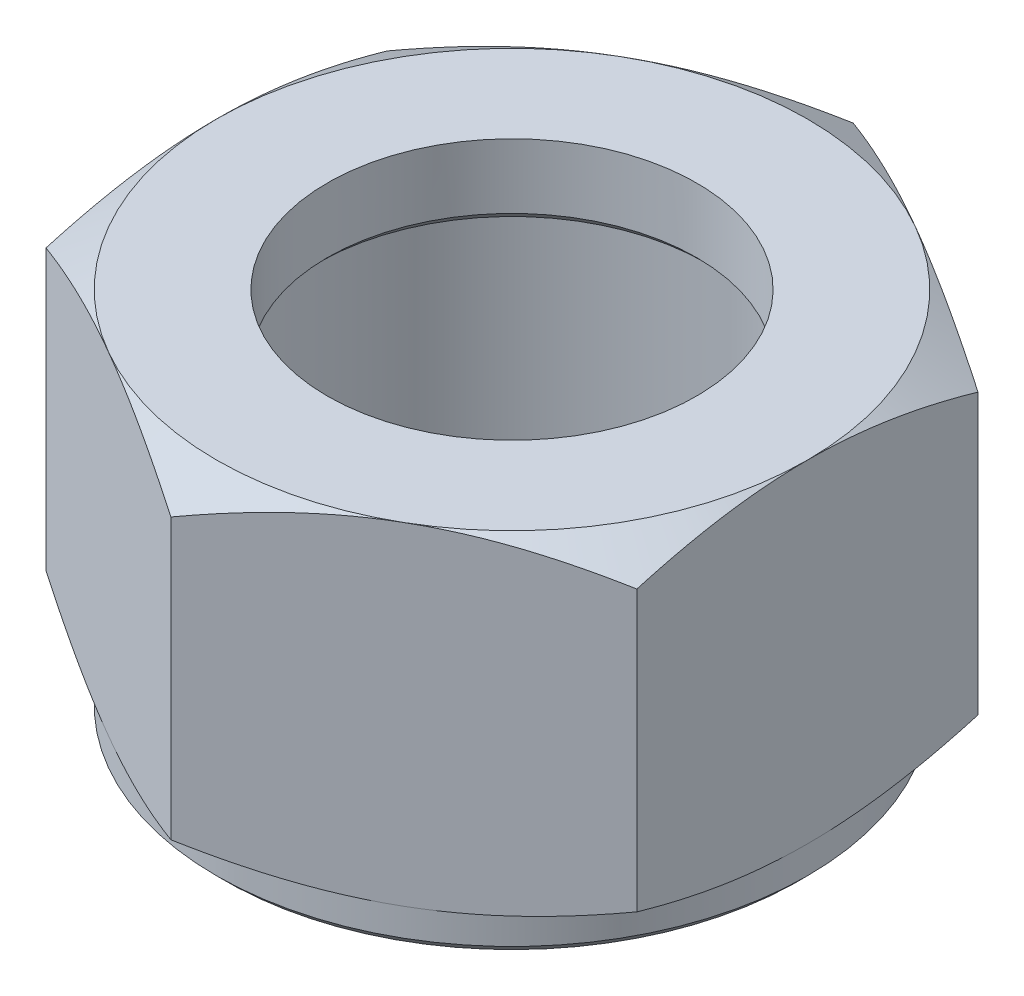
ISO-10303-21;
HEADER;
FILE_DESCRIPTION(('STEP AP214'),'2;1');
FILE_NAME('part.step','',(''),(''),'','','');
FILE_SCHEMA(('AUTOMOTIVE_DESIGN { 1 0 10303 214 1 1 1 1 }'));
ENDSEC;
DATA;
#1=APPLICATION_CONTEXT('core data for automotive mechanical design processes');
#2=APPLICATION_PROTOCOL_DEFINITION('international standard','automotive_design',2000,#1);
#3=PRODUCT_CONTEXT('',#1,'mechanical');
#4=PRODUCT('Part','Part','',(#3));
#5=PRODUCT_RELATED_PRODUCT_CATEGORY('part','',(#4));
#6=PRODUCT_DEFINITION_FORMATION('','',#4);
#7=PRODUCT_DEFINITION_CONTEXT('part definition',#1,'design');
#8=PRODUCT_DEFINITION('design','',#6,#7);
#9=PRODUCT_DEFINITION_SHAPE('','',#8);
#10=(LENGTH_UNIT() NAMED_UNIT(*) SI_UNIT(.MILLI.,.METRE.));
#11=(NAMED_UNIT(*) PLANE_ANGLE_UNIT() SI_UNIT($,.RADIAN.));
#12=(NAMED_UNIT(*) SI_UNIT($,.STERADIAN.) SOLID_ANGLE_UNIT());
#13=UNCERTAINTY_MEASURE_WITH_UNIT(LENGTH_MEASURE(1.E-05),#10,'distance_accuracy_value','');
#14=(GEOMETRIC_REPRESENTATION_CONTEXT(3) GLOBAL_UNCERTAINTY_ASSIGNED_CONTEXT((#13)) GLOBAL_UNIT_ASSIGNED_CONTEXT((#10,
#11,#12)) REPRESENTATION_CONTEXT('',''));
#15=CARTESIAN_POINT('',(0.,0.,0.));
#16=DIRECTION('',(0.,0.,1.));
#17=DIRECTION('',(1.,0.,0.));
#18=AXIS2_PLACEMENT_3D('',#15,#16,#17);
#19=CARTESIAN_POINT('',(16.,18.,-9.23760430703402));
#20=DIRECTION('',(-0.5,0.,0.866025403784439));
#21=DIRECTION('',(0.866025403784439,0.,0.5));
#22=AXIS2_PLACEMENT_3D('',#19,#20,#21);
#23=PLANE('',#22);
#24=CARTESIAN_POINT('',(-0.0002,1.42912902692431,-18.4753240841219));
#25=CARTESIAN_POINT('',(0.351473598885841,1.31191231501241,-18.2722852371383));
#26=CARTESIAN_POINT('',(0.704518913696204,1.20001468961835,-18.0684544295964));
#27=CARTESIAN_POINT('',(1.41344054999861,0.988336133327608,-17.6591583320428));
#28=CARTESIAN_POINT('',(1.76931776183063,0.888559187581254,-17.4536925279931));
#29=CARTESIAN_POINT('',(2.48459095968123,0.702463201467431,-17.04072935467));
#30=CARTESIAN_POINT('',(2.8439932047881,0.616176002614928,-16.8332283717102));
#31=CARTESIAN_POINT('',(3.56529510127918,0.45891234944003,-16.4167845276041));
#32=CARTESIAN_POINT('',(3.92719460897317,0.387935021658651,-16.2078417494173));
#33=CARTESIAN_POINT('',(4.64421780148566,0.264310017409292,-15.793868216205));
#34=CARTESIAN_POINT('',(4.99928825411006,0.211253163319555,-15.5888681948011));
#35=CARTESIAN_POINT('',(5.71105615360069,0.122288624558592,-15.1779288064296));
#36=CARTESIAN_POINT('',(6.06775363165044,0.0863812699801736,-14.9719894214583));
#37=CARTESIAN_POINT('',(6.78174778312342,0.0326223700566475,-14.5597647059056));
#38=CARTESIAN_POINT('',(7.13904323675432,0.0147493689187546,-14.3534800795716));
#39=CARTESIAN_POINT('',(7.85396395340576,-0.00255645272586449,-13.9407204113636));
#40=CARTESIAN_POINT('',(8.21158920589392,-0.00198984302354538,-13.7342453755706));
#41=CARTESIAN_POINT('',(8.88016607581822,0.0162954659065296,-13.3482423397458));
#42=CARTESIAN_POINT('',(9.19116534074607,0.0317837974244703,-13.1686868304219));
#43=CARTESIAN_POINT('',(9.81244849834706,0.0764135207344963,-12.809988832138));
#44=CARTESIAN_POINT('',(10.1227323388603,0.105555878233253,-12.6308463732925));
#45=CARTESIAN_POINT('',(10.7424161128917,0.176985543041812,-12.2730717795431));
#46=CARTESIAN_POINT('',(11.0518151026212,0.219283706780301,-12.0944401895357));
#47=CARTESIAN_POINT('',(11.6691625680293,0.316282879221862,-11.7380144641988));
#48=CARTESIAN_POINT('',(11.9771109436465,0.370984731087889,-11.5602203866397));
#49=CARTESIAN_POINT('',(12.9119052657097,0.555078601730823,-11.0205166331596));
#50=CARTESIAN_POINT('',(13.5360442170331,0.702826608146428,-10.6601698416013));
#51=CARTESIAN_POINT('',(14.7750155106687,1.03815403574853,-9.94484943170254));
#52=CARTESIAN_POINT('',(15.3898637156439,1.22565470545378,-9.58986665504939));
#53=CARTESIAN_POINT('',(16.0002,1.42912902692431,-9.23748883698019));
#54=B_SPLINE_CURVE_WITH_KNOTS('',3,(#24,#25,#26,#27,#28,#29,#30,#31,#32,#33,#34,#35,#36,#37,#38,
#39,#40,#41,#42,#43,#44,#45,#46,#47,#48,#49,#50,#51,#52,#53),.UNSPECIFIED.,.F.,.F.,(4,2,2,2,2,2,
2,2,2,2,2,2,2,2,4),(0.,1.26800386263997,2.53642350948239,3.80779337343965,5.07909068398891,
6.31900943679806,7.55895205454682,8.79741774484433,10.0358451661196,11.1139198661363,
12.1920708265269,13.2711138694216,14.350230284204,16.5559177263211,18.7572757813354),.UNSPECIFIED.);
#55=CARTESIAN_POINT('',(0.,1.42906235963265,-18.475208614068));
#56=VERTEX_POINT('',#55);
#57=CARTESIAN_POINT('',(8.00000000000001,0.,-13.856406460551));
#58=VERTEX_POINT('',#57);
#59=EDGE_CURVE('E141',#56,#58,#54,.T.);
#60=ORIENTED_EDGE('',*,*,#59,.F.);
#61=DIRECTION('',(0.,-1.,0.));
#62=VECTOR('',#61,1.);
#63=CARTESIAN_POINT('',(0.,18.,-18.475208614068));
#64=LINE('',#63,#62);
#65=CARTESIAN_POINT('',(0.,16.5709376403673,-18.475208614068));
#66=VERTEX_POINT('',#65);
#67=EDGE_CURVE('E296',#66,#56,#64,.T.);
#68=ORIENTED_EDGE('',*,*,#67,.F.);
#69=CARTESIAN_POINT('',(16.0002,16.5708709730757,-9.23748883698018));
#70=CARTESIAN_POINT('',(15.6485264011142,16.6880876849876,-9.44052768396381));
#71=CARTESIAN_POINT('',(15.2954810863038,16.7999853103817,-9.64435849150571));
#72=CARTESIAN_POINT('',(14.5865594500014,17.0116638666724,-10.0536545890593));
#73=CARTESIAN_POINT('',(14.2306822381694,17.1114408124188,-10.2591203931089));
#74=CARTESIAN_POINT('',(13.5154090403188,17.2975367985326,-10.6720835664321));
#75=CARTESIAN_POINT('',(13.1560067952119,17.3838239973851,-10.8795845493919));
#76=CARTESIAN_POINT('',(12.4347048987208,17.54108765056,-11.296028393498));
#77=CARTESIAN_POINT('',(12.0728053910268,17.6120649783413,-11.5049711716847));
#78=CARTESIAN_POINT('',(11.3557821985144,17.7356899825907,-11.918944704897));
#79=CARTESIAN_POINT('',(11.00071174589,17.7887468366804,-12.123944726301));
#80=CARTESIAN_POINT('',(10.2889438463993,17.8777113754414,-12.5348841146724));
#81=CARTESIAN_POINT('',(9.93224636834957,17.9136187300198,-12.7408234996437));
#82=CARTESIAN_POINT('',(9.21825221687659,17.9673776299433,-13.1530482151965));
#83=CARTESIAN_POINT('',(8.86095676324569,17.9852506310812,-13.3593328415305));
#84=CARTESIAN_POINT('',(8.14603604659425,18.0025564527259,-13.7720925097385));
#85=CARTESIAN_POINT('',(7.78841079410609,18.0019898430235,-13.9785675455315));
#86=CARTESIAN_POINT('',(7.11983392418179,17.9837045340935,-14.3645705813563));
#87=CARTESIAN_POINT('',(6.80883465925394,17.9682162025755,-14.5441260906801));
#88=CARTESIAN_POINT('',(6.18755150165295,17.9235864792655,-14.902824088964));
#89=CARTESIAN_POINT('',(5.87726766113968,17.8944441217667,-15.0819665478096));
#90=CARTESIAN_POINT('',(5.25758388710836,17.8230144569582,-15.439741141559));
#91=CARTESIAN_POINT('',(4.94818489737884,17.7807162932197,-15.6183727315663));
#92=CARTESIAN_POINT('',(4.33083743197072,17.6837171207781,-15.9747984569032));
#93=CARTESIAN_POINT('',(4.02288905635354,17.6290152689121,-16.1525925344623));
#94=CARTESIAN_POINT('',(3.08809473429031,17.4449213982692,-16.6922962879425));
#95=CARTESIAN_POINT('',(2.46395578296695,17.2971733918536,-17.0526430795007));
#96=CARTESIAN_POINT('',(1.22498448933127,16.9618459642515,-17.7679634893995));
#97=CARTESIAN_POINT('',(0.610136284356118,16.7743452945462,-18.1229462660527));
#98=CARTESIAN_POINT('',(-0.00020000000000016,16.5708709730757,-18.4753240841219));
#99=B_SPLINE_CURVE_WITH_KNOTS('',3,(#69,#70,#71,#72,#73,#74,#75,#76,#77,#78,#79,#80,#81,#82,#83,
#84,#85,#86,#87,#88,#89,#90,#91,#92,#93,#94,#95,#96,#97,#98),.UNSPECIFIED.,.F.,.F.,(4,2,2,2,2,2,
2,2,2,2,2,2,2,2,4),(0.,1.26800386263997,2.53642350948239,3.80779337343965,5.07909068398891,
6.31900943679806,7.55895205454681,8.79741774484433,10.0358451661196,11.1139198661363,
12.1920708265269,13.2711138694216,14.350230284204,16.5559177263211,18.7572757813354),.UNSPECIFIED.);
#100=CARTESIAN_POINT('',(8.00000000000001,18.,-13.856406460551));
#101=VERTEX_POINT('',#100);
#102=EDGE_CURVE('E557',#101,#66,#99,.T.);
#103=ORIENTED_EDGE('',*,*,#102,.F.);
#104=CARTESIAN_POINT('',(16.,16.5709376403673,-9.23760430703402));
#105=VERTEX_POINT('',#104);
#106=EDGE_CURVE('E554',#105,#101,#99,.T.);
#107=ORIENTED_EDGE('',*,*,#106,.F.);
#108=DIRECTION('',(0.,-1.,0.));
#109=VECTOR('',#108,1.);
#110=CARTESIAN_POINT('',(16.,18.,-9.23760430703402));
#111=LINE('',#110,#109);
#112=CARTESIAN_POINT('',(16.,1.42906235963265,-9.23760430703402));
#113=VERTEX_POINT('',#112);
#114=EDGE_CURVE('E163',#105,#113,#111,.T.);
#115=ORIENTED_EDGE('',*,*,#114,.T.);
#116=EDGE_CURVE('E149',#58,#113,#54,.T.);
#117=ORIENTED_EDGE('',*,*,#116,.F.);
#118=EDGE_LOOP('',(#60,#68,#103,#107,#115,#117));
#119=FACE_BOUND('',#118,.T.);
#120=ADVANCED_FACE('F39',(#119),#23,.F.);
#121=CARTESIAN_POINT('',(0.,18.,-18.475208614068));
#122=DIRECTION('',(0.5,0.,0.866025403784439));
#123=DIRECTION('',(0.866025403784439,0.,-0.5));
#124=AXIS2_PLACEMENT_3D('',#121,#122,#123);
#125=PLANE('',#124);
#126=CARTESIAN_POINT('',(-16.0002,1.42912902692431,-9.23748883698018));
#127=CARTESIAN_POINT('',(-15.6485264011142,1.3119123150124,-9.44052768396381));
#128=CARTESIAN_POINT('',(-15.2954810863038,1.20001468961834,-9.64435849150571));
#129=CARTESIAN_POINT('',(-14.5865594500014,0.988336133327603,-10.0536545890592));
#130=CARTESIAN_POINT('',(-14.2306822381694,0.888559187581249,-10.2591203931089));
#131=CARTESIAN_POINT('',(-13.5154090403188,0.702463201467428,-10.6720835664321));
#132=CARTESIAN_POINT('',(-13.1560067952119,0.616176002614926,-10.8795845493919));
#133=CARTESIAN_POINT('',(-12.4347048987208,0.458912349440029,-11.296028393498));
#134=CARTESIAN_POINT('',(-12.0728053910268,0.38793502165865,-11.5049711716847));
#135=CARTESIAN_POINT('',(-11.3557821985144,0.264310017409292,-11.918944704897));
#136=CARTESIAN_POINT('',(-11.00071174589,0.211253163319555,-12.123944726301));
#137=CARTESIAN_POINT('',(-10.2889438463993,0.122288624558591,-12.5348841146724));
#138=CARTESIAN_POINT('',(-9.93224636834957,0.0863812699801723,-12.7408234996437));
#139=CARTESIAN_POINT('',(-9.21825221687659,0.0326223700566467,-13.1530482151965));
#140=CARTESIAN_POINT('',(-8.86095676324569,0.014749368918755,-13.3593328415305));
#141=CARTESIAN_POINT('',(-8.14603604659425,-0.00255645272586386,-13.7720925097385));
#142=CARTESIAN_POINT('',(-7.78841079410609,-0.0019898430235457,-13.9785675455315));
#143=CARTESIAN_POINT('',(-7.11983392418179,0.0162954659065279,-14.3645705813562));
#144=CARTESIAN_POINT('',(-6.80883465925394,0.0317837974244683,-14.5441260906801));
#145=CARTESIAN_POINT('',(-6.18755150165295,0.0764135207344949,-14.902824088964));
#146=CARTESIAN_POINT('',(-5.87726766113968,0.105555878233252,-15.0819665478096));
#147=CARTESIAN_POINT('',(-5.25758388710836,0.176985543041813,-15.439741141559));
#148=CARTESIAN_POINT('',(-4.94818489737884,0.219283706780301,-15.6183727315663));
#149=CARTESIAN_POINT('',(-4.33083743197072,0.316282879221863,-15.9747984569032));
#150=CARTESIAN_POINT('',(-4.02288905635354,0.370984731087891,-16.1525925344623));
#151=CARTESIAN_POINT('',(-3.08809473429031,0.555078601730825,-16.6922962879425));
#152=CARTESIAN_POINT('',(-2.46395578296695,0.70282660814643,-17.0526430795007));
#153=CARTESIAN_POINT('',(-1.22498448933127,1.03815403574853,-17.7679634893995));
#154=CARTESIAN_POINT('',(-0.610136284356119,1.22565470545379,-18.1229462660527));
#155=CARTESIAN_POINT('',(0.000199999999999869,1.42912902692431,-18.4753240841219));
#156=B_SPLINE_CURVE_WITH_KNOTS('',3,(#126,#127,#128,#129,#130,#131,#132,#133,#134,#135,#136,
#137,#138,#139,#140,#141,#142,#143,#144,#145,#146,#147,#148,#149,#150,#151,#152,#153,#154,#155),
.UNSPECIFIED.,.F.,.F.,(4,2,2,2,2,2,2,2,2,2,2,2,2,2,4),(0.,1.26800386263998,2.53642350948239,
3.80779337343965,5.07909068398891,6.31900943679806,7.55895205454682,8.79741774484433,
10.0358451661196,11.1139198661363,12.1920708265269,13.2711138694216,14.350230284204,
16.5559177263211,18.7572757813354),.UNSPECIFIED.);
#157=CARTESIAN_POINT('',(-16.,1.42906235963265,-9.23760430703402));
#158=VERTEX_POINT('',#157);
#159=CARTESIAN_POINT('',(-8.00000000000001,0.,-13.856406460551));
#160=VERTEX_POINT('',#159);
#161=EDGE_CURVE('E272',#158,#160,#156,.T.);
#162=ORIENTED_EDGE('',*,*,#161,.F.);
#163=DIRECTION('',(0.,-1.,0.));
#164=VECTOR('',#163,1.);
#165=CARTESIAN_POINT('',(-16.,18.,-9.23760430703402));
#166=LINE('',#165,#164);
#167=CARTESIAN_POINT('',(-16.,16.5709376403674,-9.23760430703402));
#168=VERTEX_POINT('',#167);
#169=EDGE_CURVE('E292',#168,#158,#166,.T.);
#170=ORIENTED_EDGE('',*,*,#169,.F.);
#171=CARTESIAN_POINT('',(0.00020000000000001,16.5708709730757,-18.4753240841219));
#172=CARTESIAN_POINT('',(-0.351473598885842,16.6880876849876,-18.2722852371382));
#173=CARTESIAN_POINT('',(-0.704518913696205,16.7999853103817,-18.0684544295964));
#174=CARTESIAN_POINT('',(-1.41344054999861,17.0116638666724,-17.6591583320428));
#175=CARTESIAN_POINT('',(-1.76931776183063,17.1114408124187,-17.4536925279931));
#176=CARTESIAN_POINT('',(-2.48459095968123,17.2975367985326,-17.04072935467));
#177=CARTESIAN_POINT('',(-2.8439932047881,17.3838239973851,-16.8332283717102));
#178=CARTESIAN_POINT('',(-3.56529510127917,17.54108765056,-16.4167845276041));
#179=CARTESIAN_POINT('',(-3.92719460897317,17.6120649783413,-16.2078417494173));
#180=CARTESIAN_POINT('',(-4.64421780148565,17.7356899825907,-15.793868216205));
#181=CARTESIAN_POINT('',(-4.99928825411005,17.7887468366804,-15.5888681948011));
#182=CARTESIAN_POINT('',(-5.71105615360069,17.8777113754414,-15.1779288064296));
#183=CARTESIAN_POINT('',(-6.06775363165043,17.9136187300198,-14.9719894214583));
#184=CARTESIAN_POINT('',(-6.78174778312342,17.9673776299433,-14.5597647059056));
#185=CARTESIAN_POINT('',(-7.13904323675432,17.9852506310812,-14.3534800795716));
#186=CARTESIAN_POINT('',(-7.85396395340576,18.0025564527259,-13.9407204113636));
#187=CARTESIAN_POINT('',(-8.21158920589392,18.0019898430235,-13.7342453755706));
#188=CARTESIAN_POINT('',(-8.88016607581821,17.9837045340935,-13.3482423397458));
#189=CARTESIAN_POINT('',(-9.19116534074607,17.9682162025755,-13.1686868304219));
#190=CARTESIAN_POINT('',(-9.81244849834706,17.9235864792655,-12.809988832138));
#191=CARTESIAN_POINT('',(-10.1227323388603,17.8944441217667,-12.6308463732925));
#192=CARTESIAN_POINT('',(-10.7424161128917,17.8230144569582,-12.2730717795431));
#193=CARTESIAN_POINT('',(-11.0518151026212,17.7807162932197,-12.0944401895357));
#194=CARTESIAN_POINT('',(-11.6691625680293,17.6837171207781,-11.7380144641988));
#195=CARTESIAN_POINT('',(-11.9771109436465,17.6290152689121,-11.5602203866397));
#196=CARTESIAN_POINT('',(-12.9119052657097,17.4449213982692,-11.0205166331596));
#197=CARTESIAN_POINT('',(-13.5360442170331,17.2971733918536,-10.6601698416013));
#198=CARTESIAN_POINT('',(-14.7750155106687,16.9618459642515,-9.94484943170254));
#199=CARTESIAN_POINT('',(-15.3898637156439,16.7743452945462,-9.58986665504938));
#200=CARTESIAN_POINT('',(-16.0002,16.5708709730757,-9.23748883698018));
#201=B_SPLINE_CURVE_WITH_KNOTS('',3,(#171,#172,#173,#174,#175,#176,#177,#178,#179,#180,#181,
#182,#183,#184,#185,#186,#187,#188,#189,#190,#191,#192,#193,#194,#195,#196,#197,#198,#199,#200),
.UNSPECIFIED.,.F.,.F.,(4,2,2,2,2,2,2,2,2,2,2,2,2,2,4),(0.,1.26800386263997,2.53642350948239,
3.80779337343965,5.07909068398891,6.31900943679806,7.55895205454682,8.79741774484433,
10.0358451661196,11.1139198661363,12.1920708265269,13.2711138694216,14.350230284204,
16.5559177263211,18.7572757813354),.UNSPECIFIED.);
#202=CARTESIAN_POINT('',(-8.00000000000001,18.,-13.856406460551));
#203=VERTEX_POINT('',#202);
#204=EDGE_CURVE('E264',#203,#168,#201,.T.);
#205=ORIENTED_EDGE('',*,*,#204,.F.);
#206=EDGE_CURVE('E559',#66,#203,#201,.T.);
#207=ORIENTED_EDGE('',*,*,#206,.F.);
#208=ORIENTED_EDGE('',*,*,#67,.T.);
#209=EDGE_CURVE('E143',#160,#56,#156,.T.);
#210=ORIENTED_EDGE('',*,*,#209,.F.);
#211=EDGE_LOOP('',(#162,#170,#205,#207,#208,#210));
#212=FACE_BOUND('',#211,.T.);
#213=ADVANCED_FACE('F257',(#212),#125,.F.);
#214=CARTESIAN_POINT('',(-16.,18.,-9.23760430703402));
#215=DIRECTION('',(1.,0.,0.));
#216=DIRECTION('',(0.,0.,-1.));
#217=AXIS2_PLACEMENT_3D('',#214,#215,#216);
#218=PLANE('',#217);
#219=CARTESIAN_POINT('',(-16.,7.83360946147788,-24.8652170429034));
#220=CARTESIAN_POINT('',(-16.,7.6638149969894,-24.5154929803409));
#221=CARTESIAN_POINT('',(-16.,7.49486356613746,-24.1653598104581));
#222=CARTESIAN_POINT('',(-16.,7.15883766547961,-23.4641898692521));
#223=CARTESIAN_POINT('',(-16.,6.991763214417,-23.1131530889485));
#224=CARTESIAN_POINT('',(-16.,6.49359790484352,-22.0584663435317));
#225=CARTESIAN_POINT('',(-16.,6.16561514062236,-21.353342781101));
#226=CARTESIAN_POINT('',(-16.,5.51815907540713,-19.9345821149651));
#227=CARTESIAN_POINT('',(-16.,5.19874133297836,-19.2209195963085));
#228=CARTESIAN_POINT('',(-16.,4.57291002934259,-17.7879346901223));
#229=CARTESIAN_POINT('',(-16.,4.26649585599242,-17.0686125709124));
#230=CARTESIAN_POINT('',(-16.,3.66063236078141,-15.6001866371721));
#231=CARTESIAN_POINT('',(-16.,3.36171367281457,-14.8508627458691));
#232=CARTESIAN_POINT('',(-16.,2.78637321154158,-13.3434636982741));
#233=CARTESIAN_POINT('',(-16.,2.50995395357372,-12.5853875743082));
#234=CARTESIAN_POINT('',(-16.,1.98683181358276,-11.0607025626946));
#235=CARTESIAN_POINT('',(-16.,1.74006933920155,-10.2941142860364));
#236=CARTESIAN_POINT('',(-16.,1.28412829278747,-8.74987182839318));
#237=CARTESIAN_POINT('',(-16.,1.07493794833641,-7.9722211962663));
#238=CARTESIAN_POINT('',(-16.,0.797417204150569,-6.79934815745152));
#239=CARTESIAN_POINT('',(-16.,0.711132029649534,-6.40834872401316));
#240=CARTESIAN_POINT('',(-16.,0.551688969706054,-5.62366852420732));
#241=CARTESIAN_POINT('',(-16.,0.478530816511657,-5.22998781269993));
#242=CARTESIAN_POINT('',(-16.,0.346630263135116,-4.44021441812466));
#243=CARTESIAN_POINT('',(-16.,0.287887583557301,-4.04412178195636));
#244=CARTESIAN_POINT('',(-16.,0.18598767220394,-3.24994008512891));
#245=CARTESIAN_POINT('',(-16.,0.142829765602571,-2.85185111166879));
#246=CARTESIAN_POINT('',(-16.,0.0735005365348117,-2.05945304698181));
#247=CARTESIAN_POINT('',(-16.,0.0471136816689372,-1.66516292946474));
#248=CARTESIAN_POINT('',(-16.,0.0110403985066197,-0.875820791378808));
#249=CARTESIAN_POINT('',(-16.,0.00135369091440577,-0.480768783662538));
#250=CARTESIAN_POINT('',(-16.,-0.00108876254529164,0.309398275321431));
#251=CARTESIAN_POINT('',(-16.,0.00615584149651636,0.704513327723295));
#252=CARTESIAN_POINT('',(-16.,0.0373993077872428,1.49408485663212));
#253=CARTESIAN_POINT('',(-16.,0.0613989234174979,1.88854130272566));
#254=CARTESIAN_POINT('',(-16.,0.138542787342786,2.83460947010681));
#255=CARTESIAN_POINT('',(-16.,0.199528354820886,3.38559311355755));
#256=CARTESIAN_POINT('',(-16.,0.350884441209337,4.48351167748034));
#257=CARTESIAN_POINT('',(-16.,0.441258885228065,5.03044604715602));
#258=CARTESIAN_POINT('',(-16.,0.648178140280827,6.11971437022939));
#259=CARTESIAN_POINT('',(-16.,0.764742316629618,6.66204460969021));
#260=CARTESIAN_POINT('',(-16.,1.02048654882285,7.74128766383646));
#261=CARTESIAN_POINT('',(-16.,1.15966629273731,8.27820055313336));
#262=CARTESIAN_POINT('',(-16.,1.46075561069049,9.359174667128));
#263=CARTESIAN_POINT('',(-16.,1.62312214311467,9.90310773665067));
#264=CARTESIAN_POINT('',(-16.,1.96474996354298,10.985611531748));
#265=CARTESIAN_POINT('',(-16.,2.14401138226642,11.5241822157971));
#266=CARTESIAN_POINT('',(-16.,2.51657356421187,12.5962413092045));
#267=CARTESIAN_POINT('',(-16.,2.70987000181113,13.1297312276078));
#268=CARTESIAN_POINT('',(-16.,3.00862503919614,13.9266335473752));
#269=CARTESIAN_POINT('',(-16.,3.10967781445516,14.1917106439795));
#270=CARTESIAN_POINT('',(-16.,3.31447532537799,14.720823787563));
#271=CARTESIAN_POINT('',(-16.,3.41822006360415,14.9848598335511));
#272=CARTESIAN_POINT('',(-16.,3.70937468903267,15.7158319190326));
#273=CARTESIAN_POINT('',(-16.,3.89942166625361,16.1817184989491));
#274=CARTESIAN_POINT('',(-16.,4.28612805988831,17.1107446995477));
#275=CARTESIAN_POINT('',(-16.,4.48278764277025,17.5738842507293));
#276=CARTESIAN_POINT('',(-16.,4.88180010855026,18.4977498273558));
#277=CARTESIAN_POINT('',(-16.,5.08415349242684,18.9584756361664));
#278=CARTESIAN_POINT('',(-16.,5.49376198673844,19.8777453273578));
#279=CARTESIAN_POINT('',(-16.,5.70101715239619,20.3362891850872));
#280=CARTESIAN_POINT('',(-16.,6.32928348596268,21.709366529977));
#281=CARTESIAN_POINT('',(-16.,6.75664346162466,22.620996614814));
#282=CARTESIAN_POINT('',(-16.,7.62417267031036,24.4380629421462));
#283=CARTESIAN_POINT('',(-16.,8.06434134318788,25.3434994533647));
#284=CARTESIAN_POINT('',(-16.,8.95535693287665,27.1509311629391));
#285=CARTESIAN_POINT('',(-16.,9.40622009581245,28.0529183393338));
#286=CARTESIAN_POINT('',(-16.,10.3158072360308,29.8529233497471));
#287=CARTESIAN_POINT('',(-16.,10.7745312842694,30.7509411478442));
#288=CARTESIAN_POINT('',(-16.,11.6981559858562,32.5435335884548));
#289=CARTESIAN_POINT('',(-16.,12.1630552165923,33.4381089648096));
#290=CARTESIAN_POINT('',(-16.,13.0979396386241,35.2245918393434));
#291=CARTESIAN_POINT('',(-16.,13.5679248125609,36.1164993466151));
#292=CARTESIAN_POINT('',(-16.,14.4602541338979,37.8003234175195));
#293=CARTESIAN_POINT('',(-16.,14.8821651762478,38.5924696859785));
#294=CARTESIAN_POINT('',(-16.,15.7287936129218,40.1752615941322));
#295=CARTESIAN_POINT('',(-16.,16.1535110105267,40.9659072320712));
#296=CARTESIAN_POINT('',(-16.,17.4312886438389,43.3360171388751));
#297=CARTESIAN_POINT('',(-16.,18.2879216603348,44.913555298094));
#298=CARTESIAN_POINT('',(-16.,20.0053852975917,48.0595219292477));
#299=CARTESIAN_POINT('',(-16.,20.8661924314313,49.6279632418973));
#300=CARTESIAN_POINT('',(-16.,22.1614041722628,51.9783372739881));
#301=CARTESIAN_POINT('',(-16.,22.5937910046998,52.7613829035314));
#302=CARTESIAN_POINT('',(-16.,23.4597580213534,54.3268129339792));
#303=CARTESIAN_POINT('',(-16.,23.8933382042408,55.1091973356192));
#304=CARTESIAN_POINT('',(-16.,24.327439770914,55.8912922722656));
#305=B_SPLINE_CURVE_WITH_KNOTS('',3,(#219,#220,#221,#222,#223,#224,#225,#226,#227,#228,#229,
#230,#231,#232,#233,#234,#235,#236,#237,#238,#239,#240,#241,#242,#243,#244,#245,#246,#247,#248,
#249,#250,#251,#252,#253,#254,#255,#256,#257,#258,#259,#260,#261,#262,#263,#264,#265,#266,#267,
#268,#269,#270,#271,#272,#273,#274,#275,#276,#277,#278,#279,#280,#281,#282,#283,#284,#285,#286,
#287,#288,#289,#290,#291,#292,#293,#294,#295,#296,#297,#298,#299,#300,#301,#302,#303,#304),
.UNSPECIFIED.,.F.,.F.,(4,2,2,2,2,2,2,2,2,2,2,2,2,2,2,2,2,2,2,2,2,2,2,2,2,2,2,2,2,2,2,2,2,2,2,2,
2,2,2,2,2,2,4),(0.,1.16628848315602,2.33258860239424,4.6655318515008,7.01108141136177,
9.35652043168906,11.7764817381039,14.1967132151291,16.6119971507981,19.0265229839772,
20.2275589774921,21.4285704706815,22.6295586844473,23.8304948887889,25.0156674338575,
26.2008201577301,27.3859973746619,28.5712278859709,30.2333559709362,31.8957061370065,
33.5592895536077,35.2228500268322,36.9254702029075,38.6281035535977,40.3302143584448,
41.1812595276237,42.032305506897,43.5417152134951,45.0511629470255,46.5607439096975,
48.0703418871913,51.0906801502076,54.1108865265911,57.1360191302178,60.1611790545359,
63.1856537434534,66.2101181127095,68.902609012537,71.5951030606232,76.980427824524,
82.3478141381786,85.0312941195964,87.7147711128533),.UNSPECIFIED.);
#306=CARTESIAN_POINT('',(-16.,1.42906235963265,9.23760430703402));
#307=VERTEX_POINT('',#306);
#308=CARTESIAN_POINT('',(-16.,0.,0.));
#309=VERTEX_POINT('',#308);
#310=EDGE_CURVE('E282',#307,#309,#305,.F.);
#311=ORIENTED_EDGE('',*,*,#310,.F.);
#312=DIRECTION('',(0.,-1.,0.));
#313=VECTOR('',#312,1.);
#314=CARTESIAN_POINT('',(-16.,18.,9.23760430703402));
#315=LINE('',#314,#313);
#316=CARTESIAN_POINT('',(-16.,16.5709376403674,9.23760430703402));
#317=VERTEX_POINT('',#316);
#318=EDGE_CURVE('E297',#317,#307,#315,.T.);
#319=ORIENTED_EDGE('',*,*,#318,.F.);
#320=CARTESIAN_POINT('',(-16.,10.1663905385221,-24.8652170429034));
#321=CARTESIAN_POINT('',(-16.,10.3361850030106,-24.5154929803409));
#322=CARTESIAN_POINT('',(-16.,10.5051364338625,-24.1653598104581));
#323=CARTESIAN_POINT('',(-16.,10.8411623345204,-23.4641898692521));
#324=CARTESIAN_POINT('',(-16.,11.008236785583,-23.1131530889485));
#325=CARTESIAN_POINT('',(-16.,11.5064020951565,-22.0584663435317));
#326=CARTESIAN_POINT('',(-16.,11.8343848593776,-21.353342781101));
#327=CARTESIAN_POINT('',(-16.,12.4818409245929,-19.9345821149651));
#328=CARTESIAN_POINT('',(-16.,12.8012586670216,-19.2209195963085));
#329=CARTESIAN_POINT('',(-16.,13.4270899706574,-17.7879346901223));
#330=CARTESIAN_POINT('',(-16.,13.7335041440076,-17.0686125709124));
#331=CARTESIAN_POINT('',(-16.,14.3393676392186,-15.6001866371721));
#332=CARTESIAN_POINT('',(-16.,14.6382863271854,-14.8508627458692));
#333=CARTESIAN_POINT('',(-16.,15.2136267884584,-13.3434636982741));
#334=CARTESIAN_POINT('',(-16.,15.4900460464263,-12.5853875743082));
#335=CARTESIAN_POINT('',(-16.,16.0131681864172,-11.0607025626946));
#336=CARTESIAN_POINT('',(-16.,16.2599306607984,-10.2941142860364));
#337=CARTESIAN_POINT('',(-16.,16.7158717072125,-8.74987182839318));
#338=CARTESIAN_POINT('',(-16.,16.9250620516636,-7.9722211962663));
#339=CARTESIAN_POINT('',(-16.,17.2025827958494,-6.79934815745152));
#340=CARTESIAN_POINT('',(-16.,17.2888679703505,-6.40834872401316));
#341=CARTESIAN_POINT('',(-16.,17.4483110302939,-5.62366852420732));
#342=CARTESIAN_POINT('',(-16.,17.5214691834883,-5.22998781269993));
#343=CARTESIAN_POINT('',(-16.,17.6533697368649,-4.44021441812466));
#344=CARTESIAN_POINT('',(-16.,17.7121124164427,-4.04412178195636));
#345=CARTESIAN_POINT('',(-16.,17.8140123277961,-3.24994008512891));
#346=CARTESIAN_POINT('',(-16.,17.8571702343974,-2.85185111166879));
#347=CARTESIAN_POINT('',(-16.,17.9264994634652,-2.05945304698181));
#348=CARTESIAN_POINT('',(-16.,17.9528863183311,-1.66516292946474));
#349=CARTESIAN_POINT('',(-16.,17.9889596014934,-0.875820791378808));
#350=CARTESIAN_POINT('',(-16.,17.9986463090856,-0.480768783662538));
#351=CARTESIAN_POINT('',(-16.,18.0010887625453,0.309398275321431));
#352=CARTESIAN_POINT('',(-16.,17.9938441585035,0.704513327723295));
#353=CARTESIAN_POINT('',(-16.,17.9626006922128,1.49408485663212));
#354=CARTESIAN_POINT('',(-16.,17.9386010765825,1.88854130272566));
#355=CARTESIAN_POINT('',(-16.,17.8614572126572,2.83460947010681));
#356=CARTESIAN_POINT('',(-16.,17.8004716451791,3.38559311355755));
#357=CARTESIAN_POINT('',(-16.,17.6491155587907,4.48351167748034));
#358=CARTESIAN_POINT('',(-16.,17.5587411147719,5.03044604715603));
#359=CARTESIAN_POINT('',(-16.,17.3518218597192,6.11971437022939));
#360=CARTESIAN_POINT('',(-16.,17.2352576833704,6.66204460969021));
#361=CARTESIAN_POINT('',(-16.,16.9795134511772,7.74128766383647));
#362=CARTESIAN_POINT('',(-16.,16.8403337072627,8.27820055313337));
#363=CARTESIAN_POINT('',(-16.,16.5392443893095,9.359174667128));
#364=CARTESIAN_POINT('',(-16.,16.3768778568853,9.90310773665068));
#365=CARTESIAN_POINT('',(-16.,16.035250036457,10.985611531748));
#366=CARTESIAN_POINT('',(-16.,15.8559886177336,11.5241822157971));
#367=CARTESIAN_POINT('',(-16.,15.4834264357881,12.5962413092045));
#368=CARTESIAN_POINT('',(-16.,15.2901299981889,13.1297312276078));
#369=CARTESIAN_POINT('',(-16.,14.9913749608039,13.9266335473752));
#370=CARTESIAN_POINT('',(-16.,14.8903221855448,14.1917106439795));
#371=CARTESIAN_POINT('',(-16.,14.685524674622,14.720823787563));
#372=CARTESIAN_POINT('',(-16.,14.5817799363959,14.9848598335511));
#373=CARTESIAN_POINT('',(-16.,14.2906253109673,15.7158319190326));
#374=CARTESIAN_POINT('',(-16.,14.1005783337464,16.1817184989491));
#375=CARTESIAN_POINT('',(-16.,13.7138719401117,17.1107446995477));
#376=CARTESIAN_POINT('',(-16.,13.5172123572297,17.5738842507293));
#377=CARTESIAN_POINT('',(-16.,13.1181998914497,18.4977498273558));
#378=CARTESIAN_POINT('',(-16.,12.9158465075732,18.9584756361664));
#379=CARTESIAN_POINT('',(-16.,12.5062380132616,19.8777453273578));
#380=CARTESIAN_POINT('',(-16.,12.2989828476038,20.3362891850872));
#381=CARTESIAN_POINT('',(-16.,11.6707165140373,21.709366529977));
#382=CARTESIAN_POINT('',(-16.,11.2433565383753,22.620996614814));
#383=CARTESIAN_POINT('',(-16.,10.3758273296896,24.4380629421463));
#384=CARTESIAN_POINT('',(-16.,9.93565865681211,25.3434994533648));
#385=CARTESIAN_POINT('',(-16.,9.04464306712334,27.1509311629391));
#386=CARTESIAN_POINT('',(-16.,8.59377990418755,28.0529183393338));
#387=CARTESIAN_POINT('',(-16.,7.68419276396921,29.8529233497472));
#388=CARTESIAN_POINT('',(-16.,7.22546871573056,30.7509411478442));
#389=CARTESIAN_POINT('',(-16.,6.30184401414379,32.5435335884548));
#390=CARTESIAN_POINT('',(-16.,5.83694478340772,33.4381089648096));
#391=CARTESIAN_POINT('',(-16.,4.9020603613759,35.2245918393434));
#392=CARTESIAN_POINT('',(-16.,4.43207518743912,36.1164993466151));
#393=CARTESIAN_POINT('',(-16.,3.53974586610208,37.8003234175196));
#394=CARTESIAN_POINT('',(-16.,3.11783482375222,38.5924696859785));
#395=CARTESIAN_POINT('',(-16.,2.27120638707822,40.1752615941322));
#396=CARTESIAN_POINT('',(-16.,1.84648898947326,40.9659072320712));
#397=CARTESIAN_POINT('',(-16.,0.568711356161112,43.3360171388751));
#398=CARTESIAN_POINT('',(-16.,-0.287921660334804,44.913555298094));
#399=CARTESIAN_POINT('',(-16.,-2.00538529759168,48.0595219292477));
#400=CARTESIAN_POINT('',(-16.,-2.86619243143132,49.6279632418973));
#401=CARTESIAN_POINT('',(-16.,-4.16140417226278,51.9783372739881));
#402=CARTESIAN_POINT('',(-16.,-4.59379100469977,52.7613829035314));
#403=CARTESIAN_POINT('',(-16.,-5.45975802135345,54.3268129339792));
#404=CARTESIAN_POINT('',(-16.,-5.89333820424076,55.1091973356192));
#405=CARTESIAN_POINT('',(-16.,-6.32743977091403,55.8912922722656));
#406=B_SPLINE_CURVE_WITH_KNOTS('',3,(#320,#321,#322,#323,#324,#325,#326,#327,#328,#329,#330,
#331,#332,#333,#334,#335,#336,#337,#338,#339,#340,#341,#342,#343,#344,#345,#346,#347,#348,#349,
#350,#351,#352,#353,#354,#355,#356,#357,#358,#359,#360,#361,#362,#363,#364,#365,#366,#367,#368,
#369,#370,#371,#372,#373,#374,#375,#376,#377,#378,#379,#380,#381,#382,#383,#384,#385,#386,#387,
#388,#389,#390,#391,#392,#393,#394,#395,#396,#397,#398,#399,#400,#401,#402,#403,#404,#405),
.UNSPECIFIED.,.F.,.F.,(4,2,2,2,2,2,2,2,2,2,2,2,2,2,2,2,2,2,2,2,2,2,2,2,2,2,2,2,2,2,2,2,2,2,2,2,
2,2,2,2,2,2,4),(0.,1.16628848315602,2.33258860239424,4.66553185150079,7.01108141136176,
9.35652043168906,11.7764817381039,14.1967132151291,16.6119971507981,19.0265229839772,
20.2275589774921,21.4285704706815,22.6295586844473,23.8304948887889,25.0156674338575,
26.2008201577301,27.3859973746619,28.5712278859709,30.2333559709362,31.8957061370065,
33.5592895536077,35.2228500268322,36.9254702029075,38.6281035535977,40.3302143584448,
41.1812595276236,42.032305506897,43.5417152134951,45.0511629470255,46.5607439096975,
48.0703418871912,51.0906801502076,54.1108865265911,57.1360191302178,60.1611790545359,
63.1856537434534,66.2101181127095,68.9026090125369,71.5951030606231,76.9804278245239,
82.3478141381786,85.0312941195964,87.7147711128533),.UNSPECIFIED.);
#407=CARTESIAN_POINT('',(-16.,18.,0.));
#408=VERTEX_POINT('',#407);
#409=EDGE_CURVE('E244',#408,#317,#406,.T.);
#410=ORIENTED_EDGE('',*,*,#409,.F.);
#411=EDGE_CURVE('E294',#168,#408,#406,.T.);
#412=ORIENTED_EDGE('',*,*,#411,.F.);
#413=ORIENTED_EDGE('',*,*,#169,.T.);
#414=EDGE_CURVE('E202',#309,#158,#305,.F.);
#415=ORIENTED_EDGE('',*,*,#414,.F.);
#416=EDGE_LOOP('',(#311,#319,#410,#412,#413,#415));
#417=FACE_BOUND('',#416,.T.);
#418=ADVANCED_FACE('F252',(#417),#218,.F.);
#419=CARTESIAN_POINT('',(-16.,18.,9.23760430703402));
#420=DIRECTION('',(0.5,0.,-0.866025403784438));
#421=DIRECTION('',(-0.866025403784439,0.,-0.5));
#422=AXIS2_PLACEMENT_3D('',#419,#420,#421);
#423=PLANE('',#422);
#424=CARTESIAN_POINT('',(0.000199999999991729,1.42912902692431,18.4753240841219));
#425=CARTESIAN_POINT('',(-0.35147359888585,1.31191231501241,18.2722852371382));
#426=CARTESIAN_POINT('',(-0.704518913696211,1.20001468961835,18.0684544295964));
#427=CARTESIAN_POINT('',(-1.41344054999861,0.988336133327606,17.6591583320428));
#428=CARTESIAN_POINT('',(-1.76931776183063,0.888559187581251,17.4536925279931));
#429=CARTESIAN_POINT('',(-2.48459095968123,0.70246320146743,17.04072935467));
#430=CARTESIAN_POINT('',(-2.8439932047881,0.616176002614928,16.8332283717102));
#431=CARTESIAN_POINT('',(-3.56529510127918,0.458912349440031,16.4167845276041));
#432=CARTESIAN_POINT('',(-3.92719460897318,0.387935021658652,16.2078417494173));
#433=CARTESIAN_POINT('',(-4.64421780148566,0.264310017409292,15.793868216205));
#434=CARTESIAN_POINT('',(-4.99928825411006,0.211253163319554,15.5888681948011));
#435=CARTESIAN_POINT('',(-5.71105615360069,0.122288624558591,15.1779288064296));
#436=CARTESIAN_POINT('',(-6.06775363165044,0.0863812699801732,14.9719894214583));
#437=CARTESIAN_POINT('',(-6.78174778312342,0.0326223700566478,14.5597647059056));
#438=CARTESIAN_POINT('',(-7.13904323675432,0.0147493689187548,14.3534800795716));
#439=CARTESIAN_POINT('',(-7.85396395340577,-0.00255645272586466,13.9407204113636));
#440=CARTESIAN_POINT('',(-8.21158920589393,-0.00198984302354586,13.7342453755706));
#441=CARTESIAN_POINT('',(-8.88016607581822,0.016295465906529,13.3482423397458));
#442=CARTESIAN_POINT('',(-9.19116534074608,0.03178379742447,13.1686868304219));
#443=CARTESIAN_POINT('',(-9.81244849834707,0.076413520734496,12.809988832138));
#444=CARTESIAN_POINT('',(-10.1227323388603,0.105555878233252,12.6308463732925));
#445=CARTESIAN_POINT('',(-10.7424161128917,0.176985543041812,12.2730717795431));
#446=CARTESIAN_POINT('',(-11.0518151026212,0.2192837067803,12.0944401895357));
#447=CARTESIAN_POINT('',(-11.6691625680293,0.316282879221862,11.7380144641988));
#448=CARTESIAN_POINT('',(-11.9771109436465,0.37098473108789,11.5602203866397));
#449=CARTESIAN_POINT('',(-12.9119052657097,0.555078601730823,11.0205166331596));
#450=CARTESIAN_POINT('',(-13.5360442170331,0.702826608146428,10.6601698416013));
#451=CARTESIAN_POINT('',(-14.7750155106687,1.03815403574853,9.94484943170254));
#452=CARTESIAN_POINT('',(-15.3898637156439,1.22565470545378,9.58986665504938));
#453=CARTESIAN_POINT('',(-16.0002,1.42912902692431,9.23748883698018));
#454=B_SPLINE_CURVE_WITH_KNOTS('',3,(#424,#425,#426,#427,#428,#429,#430,#431,#432,#433,#434,
#435,#436,#437,#438,#439,#440,#441,#442,#443,#444,#445,#446,#447,#448,#449,#450,#451,#452,#453),
.UNSPECIFIED.,.F.,.F.,(4,2,2,2,2,2,2,2,2,2,2,2,2,2,4),(0.,1.26800386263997,2.53642350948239,
3.80779337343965,5.07909068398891,6.31900943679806,7.55895205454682,8.79741774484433,
10.0358451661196,11.1139198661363,12.1920708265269,13.2711138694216,14.350230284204,
16.5559177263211,18.7572757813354),.UNSPECIFIED.);
#455=CARTESIAN_POINT('',(0.,1.42906235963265,18.475208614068));
#456=VERTEX_POINT('',#455);
#457=CARTESIAN_POINT('',(-8.00000000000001,0.,13.856406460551));
#458=VERTEX_POINT('',#457);
#459=EDGE_CURVE('E178',#456,#458,#454,.T.);
#460=ORIENTED_EDGE('',*,*,#459,.F.);
#461=DIRECTION('',(0.,-1.,0.));
#462=VECTOR('',#461,1.);
#463=CARTESIAN_POINT('',(0.,18.,18.475208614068));
#464=LINE('',#463,#462);
#465=CARTESIAN_POINT('',(0.,16.5709376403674,18.475208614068));
#466=VERTEX_POINT('',#465);
#467=EDGE_CURVE('E301',#466,#456,#464,.T.);
#468=ORIENTED_EDGE('',*,*,#467,.F.);
#469=CARTESIAN_POINT('',(-16.0002,16.5708709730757,9.23748883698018));
#470=CARTESIAN_POINT('',(-15.6485264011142,16.6880876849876,9.4405276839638));
#471=CARTESIAN_POINT('',(-15.2954810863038,16.7999853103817,9.6443584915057));
#472=CARTESIAN_POINT('',(-14.5865594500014,17.0116638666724,10.0536545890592));
#473=CARTESIAN_POINT('',(-14.2306822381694,17.1114408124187,10.2591203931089));
#474=CARTESIAN_POINT('',(-13.5154090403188,17.2975367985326,10.6720835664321));
#475=CARTESIAN_POINT('',(-13.1560067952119,17.3838239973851,10.8795845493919));
#476=CARTESIAN_POINT('',(-12.4347048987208,17.54108765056,11.296028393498));
#477=CARTESIAN_POINT('',(-12.0728053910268,17.6120649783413,11.5049711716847));
#478=CARTESIAN_POINT('',(-11.3557821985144,17.7356899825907,11.918944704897));
#479=CARTESIAN_POINT('',(-11.00071174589,17.7887468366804,12.123944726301));
#480=CARTESIAN_POINT('',(-10.2889438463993,17.8777113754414,12.5348841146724));
#481=CARTESIAN_POINT('',(-9.93224636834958,17.9136187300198,12.7408234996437));
#482=CARTESIAN_POINT('',(-9.2182522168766,17.9673776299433,13.1530482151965));
#483=CARTESIAN_POINT('',(-8.8609567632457,17.9852506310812,13.3593328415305));
#484=CARTESIAN_POINT('',(-8.14603604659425,18.0025564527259,13.7720925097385));
#485=CARTESIAN_POINT('',(-7.78841079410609,18.0019898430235,13.9785675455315));
#486=CARTESIAN_POINT('',(-7.1198339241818,17.9837045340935,14.3645705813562));
#487=CARTESIAN_POINT('',(-6.80883465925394,17.9682162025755,14.5441260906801));
#488=CARTESIAN_POINT('',(-6.18755150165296,17.9235864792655,14.902824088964));
#489=CARTESIAN_POINT('',(-5.87726766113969,17.8944441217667,15.0819665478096));
#490=CARTESIAN_POINT('',(-5.25758388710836,17.8230144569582,15.439741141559));
#491=CARTESIAN_POINT('',(-4.94818489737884,17.7807162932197,15.6183727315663));
#492=CARTESIAN_POINT('',(-4.33083743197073,17.6837171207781,15.9747984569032));
#493=CARTESIAN_POINT('',(-4.02288905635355,17.6290152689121,16.1525925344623));
#494=CARTESIAN_POINT('',(-3.08809473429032,17.4449213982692,16.6922962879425));
#495=CARTESIAN_POINT('',(-2.46395578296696,17.2971733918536,17.0526430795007));
#496=CARTESIAN_POINT('',(-1.22498448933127,16.9618459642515,17.7679634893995));
#497=CARTESIAN_POINT('',(-0.610136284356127,16.7743452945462,18.1229462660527));
#498=CARTESIAN_POINT('',(0.000199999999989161,16.5708709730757,18.4753240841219));
#499=B_SPLINE_CURVE_WITH_KNOTS('',3,(#469,#470,#471,#472,#473,#474,#475,#476,#477,#478,#479,
#480,#481,#482,#483,#484,#485,#486,#487,#488,#489,#490,#491,#492,#493,#494,#495,#496,#497,#498),
.UNSPECIFIED.,.F.,.F.,(4,2,2,2,2,2,2,2,2,2,2,2,2,2,4),(0.,1.26800386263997,2.53642350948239,
3.80779337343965,5.07909068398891,6.31900943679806,7.55895205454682,8.79741774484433,
10.0358451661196,11.1139198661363,12.1920708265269,13.2711138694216,14.350230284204,
16.5559177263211,18.7572757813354),.UNSPECIFIED.);
#500=CARTESIAN_POINT('',(-8.00000000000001,18.,13.856406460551));
#501=VERTEX_POINT('',#500);
#502=EDGE_CURVE('E238',#501,#466,#499,.T.);
#503=ORIENTED_EDGE('',*,*,#502,.F.);
#504=EDGE_CURVE('E243',#317,#501,#499,.T.);
#505=ORIENTED_EDGE('',*,*,#504,.F.);
#506=ORIENTED_EDGE('',*,*,#318,.T.);
#507=EDGE_CURVE('E273',#458,#307,#454,.T.);
#508=ORIENTED_EDGE('',*,*,#507,.F.);
#509=EDGE_LOOP('',(#460,#468,#503,#505,#506,#508));
#510=FACE_BOUND('',#509,.T.);
#511=ADVANCED_FACE('F249',(#510),#423,.F.);
#512=CARTESIAN_POINT('',(0.,18.,18.475208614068));
#513=DIRECTION('',(-0.5,0.,-0.866025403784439));
#514=DIRECTION('',(-0.866025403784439,0.,0.5));
#515=AXIS2_PLACEMENT_3D('',#512,#513,#514);
#516=PLANE('',#515);
#517=CARTESIAN_POINT('',(16.0002,1.42912902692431,9.23748883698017));
#518=CARTESIAN_POINT('',(15.6485264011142,1.3119123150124,9.4405276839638));
#519=CARTESIAN_POINT('',(15.2954810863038,1.20001468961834,9.6443584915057));
#520=CARTESIAN_POINT('',(14.5865594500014,0.988336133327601,10.0536545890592));
#521=CARTESIAN_POINT('',(14.2306822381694,0.888559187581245,10.2591203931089));
#522=CARTESIAN_POINT('',(13.5154090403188,0.702463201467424,10.6720835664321));
#523=CARTESIAN_POINT('',(13.1560067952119,0.616176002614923,10.8795845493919));
#524=CARTESIAN_POINT('',(12.4347048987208,0.458912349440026,11.296028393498));
#525=CARTESIAN_POINT('',(12.0728053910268,0.387935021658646,11.5049711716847));
#526=CARTESIAN_POINT('',(11.3557821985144,0.264310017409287,11.918944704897));
#527=CARTESIAN_POINT('',(11.00071174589,0.211253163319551,12.123944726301));
#528=CARTESIAN_POINT('',(10.2889438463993,0.122288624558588,12.5348841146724));
#529=CARTESIAN_POINT('',(9.93224636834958,0.0863812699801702,12.7408234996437));
#530=CARTESIAN_POINT('',(9.21825221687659,0.0326223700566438,13.1530482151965));
#531=CARTESIAN_POINT('',(8.86095676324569,0.0147493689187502,13.3593328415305));
#532=CARTESIAN_POINT('',(8.14603604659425,-0.00255645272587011,13.7720925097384));
#533=CARTESIAN_POINT('',(7.78841079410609,-0.00198984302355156,13.9785675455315));
#534=CARTESIAN_POINT('',(7.11983392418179,0.0162954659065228,14.3645705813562));
#535=CARTESIAN_POINT('',(6.80883465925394,0.0317837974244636,14.5441260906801));
#536=CARTESIAN_POINT('',(6.18755150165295,0.0764135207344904,14.902824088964));
#537=CARTESIAN_POINT('',(5.87726766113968,0.105555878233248,15.0819665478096));
#538=CARTESIAN_POINT('',(5.25758388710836,0.176985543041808,15.439741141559));
#539=CARTESIAN_POINT('',(4.94818489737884,0.219283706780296,15.6183727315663));
#540=CARTESIAN_POINT('',(4.33083743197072,0.316282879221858,15.9747984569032));
#541=CARTESIAN_POINT('',(4.02288905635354,0.370984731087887,16.1525925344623));
#542=CARTESIAN_POINT('',(3.08809473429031,0.555078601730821,16.6922962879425));
#543=CARTESIAN_POINT('',(2.46395578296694,0.702826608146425,17.0526430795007));
#544=CARTESIAN_POINT('',(1.22498448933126,1.03815403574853,17.7679634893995));
#545=CARTESIAN_POINT('',(0.610136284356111,1.22565470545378,18.1229462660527));
#546=CARTESIAN_POINT('',(-0.00020000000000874,1.42912902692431,18.4753240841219));
#547=B_SPLINE_CURVE_WITH_KNOTS('',3,(#517,#518,#519,#520,#521,#522,#523,#524,#525,#526,#527,
#528,#529,#530,#531,#532,#533,#534,#535,#536,#537,#538,#539,#540,#541,#542,#543,#544,#545,#546),
.UNSPECIFIED.,.F.,.F.,(4,2,2,2,2,2,2,2,2,2,2,2,2,2,4),(0.,1.26800386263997,2.53642350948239,
3.80779337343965,5.07909068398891,6.31900943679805,7.55895205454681,8.79741774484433,
10.0358451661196,11.1139198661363,12.1920708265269,13.2711138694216,14.350230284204,
16.5559177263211,18.7572757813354),.UNSPECIFIED.);
#548=CARTESIAN_POINT('',(16.,1.42906235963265,9.23760430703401));
#549=VERTEX_POINT('',#548);
#550=CARTESIAN_POINT('',(8.00000000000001,0.,13.856406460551));
#551=VERTEX_POINT('',#550);
#552=EDGE_CURVE('E164',#549,#551,#547,.T.);
#553=ORIENTED_EDGE('',*,*,#552,.F.);
#554=DIRECTION('',(0.,-1.,0.));
#555=VECTOR('',#554,1.);
#556=CARTESIAN_POINT('',(16.,18.,9.23760430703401));
#557=LINE('',#556,#555);
#558=CARTESIAN_POINT('',(16.,16.5709376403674,9.23760430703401));
#559=VERTEX_POINT('',#558);
#560=EDGE_CURVE('E551',#559,#549,#557,.T.);
#561=ORIENTED_EDGE('',*,*,#560,.F.);
#562=CARTESIAN_POINT('',(-0.000200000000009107,16.5708709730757,18.4753240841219));
#563=CARTESIAN_POINT('',(0.351473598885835,16.6880876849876,18.2722852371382));
#564=CARTESIAN_POINT('',(0.704518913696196,16.7999853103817,18.0684544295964));
#565=CARTESIAN_POINT('',(1.4134405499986,17.0116638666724,17.6591583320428));
#566=CARTESIAN_POINT('',(1.76931776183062,17.1114408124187,17.4536925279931));
#567=CARTESIAN_POINT('',(2.48459095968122,17.2975367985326,17.04072935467));
#568=CARTESIAN_POINT('',(2.84399320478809,17.3838239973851,16.8332283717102));
#569=CARTESIAN_POINT('',(3.56529510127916,17.54108765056,16.4167845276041));
#570=CARTESIAN_POINT('',(3.92719460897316,17.6120649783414,16.2078417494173));
#571=CARTESIAN_POINT('',(4.64421780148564,17.7356899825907,15.793868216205));
#572=CARTESIAN_POINT('',(4.99928825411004,17.7887468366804,15.5888681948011));
#573=CARTESIAN_POINT('',(5.71105615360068,17.8777113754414,15.1779288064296));
#574=CARTESIAN_POINT('',(6.06775363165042,17.9136187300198,14.9719894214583));
#575=CARTESIAN_POINT('',(6.78174778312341,17.9673776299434,14.5597647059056));
#576=CARTESIAN_POINT('',(7.13904323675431,17.9852506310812,14.3534800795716));
#577=CARTESIAN_POINT('',(7.85396395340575,18.0025564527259,13.9407204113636));
#578=CARTESIAN_POINT('',(8.21158920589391,18.0019898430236,13.7342453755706));
#579=CARTESIAN_POINT('',(8.8801660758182,17.9837045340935,13.3482423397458));
#580=CARTESIAN_POINT('',(9.19116534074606,17.9682162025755,13.1686868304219));
#581=CARTESIAN_POINT('',(9.81244849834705,17.9235864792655,12.809988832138));
#582=CARTESIAN_POINT('',(10.1227323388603,17.8944441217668,12.6308463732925));
#583=CARTESIAN_POINT('',(10.7424161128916,17.8230144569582,12.2730717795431));
#584=CARTESIAN_POINT('',(11.0518151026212,17.7807162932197,12.0944401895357));
#585=CARTESIAN_POINT('',(11.6691625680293,17.6837171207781,11.7380144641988));
#586=CARTESIAN_POINT('',(11.9771109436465,17.6290152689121,11.5602203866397));
#587=CARTESIAN_POINT('',(12.9119052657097,17.4449213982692,11.0205166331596));
#588=CARTESIAN_POINT('',(13.5360442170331,17.2971733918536,10.6601698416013));
#589=CARTESIAN_POINT('',(14.7750155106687,16.9618459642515,9.94484943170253));
#590=CARTESIAN_POINT('',(15.3898637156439,16.7743452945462,9.58986665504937));
#591=CARTESIAN_POINT('',(16.0002,16.5708709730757,9.23748883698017));
#592=B_SPLINE_CURVE_WITH_KNOTS('',3,(#562,#563,#564,#565,#566,#567,#568,#569,#570,#571,#572,
#573,#574,#575,#576,#577,#578,#579,#580,#581,#582,#583,#584,#585,#586,#587,#588,#589,#590,#591),
.UNSPECIFIED.,.F.,.F.,(4,2,2,2,2,2,2,2,2,2,2,2,2,2,4),(0.,1.26800386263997,2.53642350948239,
3.80779337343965,5.07909068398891,6.31900943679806,7.55895205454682,8.79741774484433,
10.0358451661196,11.1139198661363,12.1920708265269,13.2711138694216,14.350230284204,
16.5559177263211,18.7572757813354),.UNSPECIFIED.);
#593=CARTESIAN_POINT('',(8.00000000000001,18.,13.856406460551));
#594=VERTEX_POINT('',#593);
#595=EDGE_CURVE('E232',#594,#559,#592,.T.);
#596=ORIENTED_EDGE('',*,*,#595,.F.);
#597=EDGE_CURVE('E237',#466,#594,#592,.T.);
#598=ORIENTED_EDGE('',*,*,#597,.F.);
#599=ORIENTED_EDGE('',*,*,#467,.T.);
#600=EDGE_CURVE('E148',#551,#456,#547,.T.);
#601=ORIENTED_EDGE('',*,*,#600,.F.);
#602=EDGE_LOOP('',(#553,#561,#596,#598,#599,#601));
#603=FACE_BOUND('',#602,.T.);
#604=ADVANCED_FACE('F220',(#603),#516,.F.);
#605=CARTESIAN_POINT('',(16.,18.,9.23760430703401));
#606=DIRECTION('',(-1.,0.,0.));
#607=DIRECTION('',(0.,0.,1.));
#608=AXIS2_PLACEMENT_3D('',#605,#606,#607);
#609=PLANE('',#608);
#610=CARTESIAN_POINT('',(16.,7.83360946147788,-24.8652170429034));
#611=CARTESIAN_POINT('',(16.,7.6638149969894,-24.5154929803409));
#612=CARTESIAN_POINT('',(16.,7.49486356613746,-24.1653598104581));
#613=CARTESIAN_POINT('',(16.,7.15883766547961,-23.4641898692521));
#614=CARTESIAN_POINT('',(16.,6.991763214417,-23.1131530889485));
#615=CARTESIAN_POINT('',(16.,6.49359790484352,-22.0584663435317));
#616=CARTESIAN_POINT('',(16.,6.16561514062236,-21.353342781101));
#617=CARTESIAN_POINT('',(16.,5.51815907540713,-19.9345821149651));
#618=CARTESIAN_POINT('',(16.,5.19874133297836,-19.2209195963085));
#619=CARTESIAN_POINT('',(16.,4.57291002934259,-17.7879346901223));
#620=CARTESIAN_POINT('',(16.,4.26649585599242,-17.0686125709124));
#621=CARTESIAN_POINT('',(16.,3.66063236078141,-15.6001866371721));
#622=CARTESIAN_POINT('',(16.,3.36171367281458,-14.8508627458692));
#623=CARTESIAN_POINT('',(16.,2.78637321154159,-13.3434636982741));
#624=CARTESIAN_POINT('',(16.,2.50995395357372,-12.5853875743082));
#625=CARTESIAN_POINT('',(16.,1.98683181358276,-11.0607025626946));
#626=CARTESIAN_POINT('',(16.,1.74006933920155,-10.2941142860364));
#627=CARTESIAN_POINT('',(16.,1.28412829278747,-8.74987182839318));
#628=CARTESIAN_POINT('',(16.,1.07493794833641,-7.9722211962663));
#629=CARTESIAN_POINT('',(16.,0.797417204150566,-6.79934815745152));
#630=CARTESIAN_POINT('',(16.,0.711132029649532,-6.40834872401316));
#631=CARTESIAN_POINT('',(16.,0.551688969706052,-5.62366852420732));
#632=CARTESIAN_POINT('',(16.,0.478530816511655,-5.22998781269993));
#633=CARTESIAN_POINT('',(16.,0.346630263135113,-4.44021441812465));
#634=CARTESIAN_POINT('',(16.,0.287887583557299,-4.04412178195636));
#635=CARTESIAN_POINT('',(16.,0.185987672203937,-3.24994008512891));
#636=CARTESIAN_POINT('',(16.,0.142829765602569,-2.85185111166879));
#637=CARTESIAN_POINT('',(16.,0.0735005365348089,-2.05945304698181));
#638=CARTESIAN_POINT('',(16.,0.0471136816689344,-1.66516292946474));
#639=CARTESIAN_POINT('',(16.,0.0110403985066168,-0.875820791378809));
#640=CARTESIAN_POINT('',(16.,0.00135369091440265,-0.480768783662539));
#641=CARTESIAN_POINT('',(16.,-0.0010887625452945,0.309398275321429));
#642=CARTESIAN_POINT('',(16.,0.0061558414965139,0.704513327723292));
#643=CARTESIAN_POINT('',(16.,0.0373993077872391,1.49408485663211));
#644=CARTESIAN_POINT('',(16.,0.0613989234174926,1.88854130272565));
#645=CARTESIAN_POINT('',(16.,0.13854278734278,2.83460947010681));
#646=CARTESIAN_POINT('',(16.,0.199528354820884,3.38559311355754));
#647=CARTESIAN_POINT('',(16.,0.350884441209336,4.48351167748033));
#648=CARTESIAN_POINT('',(16.,0.441258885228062,5.03044604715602));
#649=CARTESIAN_POINT('',(16.,0.648178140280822,6.11971437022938));
#650=CARTESIAN_POINT('',(16.,0.764742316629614,6.66204460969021));
#651=CARTESIAN_POINT('',(16.,1.02048654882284,7.74128766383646));
#652=CARTESIAN_POINT('',(16.,1.15966629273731,8.27820055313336));
#653=CARTESIAN_POINT('',(16.,1.46075561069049,9.359174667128));
#654=CARTESIAN_POINT('',(16.,1.62312214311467,9.90310773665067));
#655=CARTESIAN_POINT('',(16.,1.96474996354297,10.985611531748));
#656=CARTESIAN_POINT('',(16.,2.14401138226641,11.524182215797));
#657=CARTESIAN_POINT('',(16.,2.51657356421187,12.5962413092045));
#658=CARTESIAN_POINT('',(16.,2.70987000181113,13.1297312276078));
#659=CARTESIAN_POINT('',(16.,3.00862503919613,13.9266335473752));
#660=CARTESIAN_POINT('',(16.,3.10967781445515,14.1917106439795));
#661=CARTESIAN_POINT('',(16.,3.31447532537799,14.720823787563));
#662=CARTESIAN_POINT('',(16.,3.41822006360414,14.984859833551));
#663=CARTESIAN_POINT('',(16.,3.70937468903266,15.7158319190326));
#664=CARTESIAN_POINT('',(16.,3.8994216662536,16.1817184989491));
#665=CARTESIAN_POINT('',(16.,4.2861280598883,17.1107446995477));
#666=CARTESIAN_POINT('',(16.,4.48278764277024,17.5738842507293));
#667=CARTESIAN_POINT('',(16.,4.88180010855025,18.4977498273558));
#668=CARTESIAN_POINT('',(16.,5.08415349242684,18.9584756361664));
#669=CARTESIAN_POINT('',(16.,5.49376198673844,19.8777453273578));
#670=CARTESIAN_POINT('',(16.,5.70101715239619,20.3362891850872));
#671=CARTESIAN_POINT('',(16.,6.32928348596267,21.709366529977));
#672=CARTESIAN_POINT('',(16.,6.75664346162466,22.620996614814));
#673=CARTESIAN_POINT('',(16.,7.62417267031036,24.4380629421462));
#674=CARTESIAN_POINT('',(16.,8.06434134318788,25.3434994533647));
#675=CARTESIAN_POINT('',(16.,8.95535693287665,27.1509311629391));
#676=CARTESIAN_POINT('',(16.,9.40622009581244,28.0529183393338));
#677=CARTESIAN_POINT('',(16.,10.3158072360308,29.8529233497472));
#678=CARTESIAN_POINT('',(16.,10.7745312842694,30.7509411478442));
#679=CARTESIAN_POINT('',(16.,11.6981559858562,32.5435335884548));
#680=CARTESIAN_POINT('',(16.,12.1630552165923,33.4381089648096));
#681=CARTESIAN_POINT('',(16.,13.0979396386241,35.2245918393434));
#682=CARTESIAN_POINT('',(16.,13.5679248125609,36.1164993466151));
#683=CARTESIAN_POINT('',(16.,14.4602541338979,37.8003234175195));
#684=CARTESIAN_POINT('',(16.,14.8821651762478,38.5924696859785));
#685=CARTESIAN_POINT('',(16.,15.7287936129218,40.1752615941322));
#686=CARTESIAN_POINT('',(16.,16.1535110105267,40.9659072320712));
#687=CARTESIAN_POINT('',(16.,17.4312886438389,43.336017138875));
#688=CARTESIAN_POINT('',(16.,18.2879216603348,44.913555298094));
#689=CARTESIAN_POINT('',(16.,20.0053852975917,48.0595219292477));
#690=CARTESIAN_POINT('',(16.,20.8661924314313,49.6279632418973));
#691=CARTESIAN_POINT('',(16.,22.1614041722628,51.978337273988));
#692=CARTESIAN_POINT('',(16.,22.5937910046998,52.7613829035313));
#693=CARTESIAN_POINT('',(16.,23.4597580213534,54.3268129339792));
#694=CARTESIAN_POINT('',(16.,23.8933382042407,55.1091973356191));
#695=CARTESIAN_POINT('',(16.,24.327439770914,55.8912922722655));
#696=B_SPLINE_CURVE_WITH_KNOTS('',3,(#610,#611,#612,#613,#614,#615,#616,#617,#618,#619,#620,
#621,#622,#623,#624,#625,#626,#627,#628,#629,#630,#631,#632,#633,#634,#635,#636,#637,#638,#639,
#640,#641,#642,#643,#644,#645,#646,#647,#648,#649,#650,#651,#652,#653,#654,#655,#656,#657,#658,
#659,#660,#661,#662,#663,#664,#665,#666,#667,#668,#669,#670,#671,#672,#673,#674,#675,#676,#677,
#678,#679,#680,#681,#682,#683,#684,#685,#686,#687,#688,#689,#690,#691,#692,#693,#694,#695),
.UNSPECIFIED.,.F.,.F.,(4,2,2,2,2,2,2,2,2,2,2,2,2,2,2,2,2,2,2,2,2,2,2,2,2,2,2,2,2,2,2,2,2,2,2,2,
2,2,2,2,2,2,4),(0.,1.16628848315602,2.33258860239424,4.66553185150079,7.01108141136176,
9.35652043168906,11.7764817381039,14.1967132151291,16.6119971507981,19.0265229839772,
20.2275589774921,21.4285704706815,22.6295586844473,23.8304948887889,25.0156674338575,
26.2008201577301,27.3859973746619,28.5712278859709,30.2333559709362,31.8957061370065,
33.5592895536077,35.2228500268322,36.9254702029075,38.6281035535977,40.3302143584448,
41.1812595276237,42.032305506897,43.5417152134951,45.0511629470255,46.5607439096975,
48.0703418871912,51.0906801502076,54.1108865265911,57.1360191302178,60.1611790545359,
63.1856537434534,66.2101181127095,68.902609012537,71.5951030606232,76.980427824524,
82.3478141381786,85.0312941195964,87.7147711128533),.UNSPECIFIED.);
#697=CARTESIAN_POINT('',(16.,0.,0.));
#698=VERTEX_POINT('',#697);
#699=EDGE_CURVE('E155',#113,#698,#696,.T.);
#700=ORIENTED_EDGE('',*,*,#699,.F.);
#701=ORIENTED_EDGE('',*,*,#114,.F.);
#702=CARTESIAN_POINT('',(16.,10.1663905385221,-24.8652170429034));
#703=CARTESIAN_POINT('',(16.,10.3361850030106,-24.5154929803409));
#704=CARTESIAN_POINT('',(16.,10.5051364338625,-24.1653598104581));
#705=CARTESIAN_POINT('',(16.,10.8411623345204,-23.4641898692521));
#706=CARTESIAN_POINT('',(16.,11.008236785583,-23.1131530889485));
#707=CARTESIAN_POINT('',(16.,11.5064020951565,-22.0584663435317));
#708=CARTESIAN_POINT('',(16.,11.8343848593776,-21.353342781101));
#709=CARTESIAN_POINT('',(16.,12.4818409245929,-19.9345821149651));
#710=CARTESIAN_POINT('',(16.,12.8012586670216,-19.2209195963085));
#711=CARTESIAN_POINT('',(16.,13.4270899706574,-17.7879346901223));
#712=CARTESIAN_POINT('',(16.,13.7335041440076,-17.0686125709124));
#713=CARTESIAN_POINT('',(16.,14.3393676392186,-15.6001866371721));
#714=CARTESIAN_POINT('',(16.,14.6382863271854,-14.8508627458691));
#715=CARTESIAN_POINT('',(16.,15.2136267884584,-13.3434636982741));
#716=CARTESIAN_POINT('',(16.,15.4900460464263,-12.5853875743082));
#717=CARTESIAN_POINT('',(16.,16.0131681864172,-11.0607025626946));
#718=CARTESIAN_POINT('',(16.,16.2599306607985,-10.2941142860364));
#719=CARTESIAN_POINT('',(16.,16.7158717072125,-8.74987182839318));
#720=CARTESIAN_POINT('',(16.,16.9250620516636,-7.9722211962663));
#721=CARTESIAN_POINT('',(16.,17.2025827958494,-6.79934815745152));
#722=CARTESIAN_POINT('',(16.,17.2888679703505,-6.40834872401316));
#723=CARTESIAN_POINT('',(16.,17.4483110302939,-5.62366852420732));
#724=CARTESIAN_POINT('',(16.,17.5214691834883,-5.22998781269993));
#725=CARTESIAN_POINT('',(16.,17.6533697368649,-4.44021441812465));
#726=CARTESIAN_POINT('',(16.,17.7121124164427,-4.04412178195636));
#727=CARTESIAN_POINT('',(16.,17.8140123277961,-3.24994008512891));
#728=CARTESIAN_POINT('',(16.,17.8571702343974,-2.85185111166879));
#729=CARTESIAN_POINT('',(16.,17.9264994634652,-2.05945304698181));
#730=CARTESIAN_POINT('',(16.,17.9528863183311,-1.66516292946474));
#731=CARTESIAN_POINT('',(16.,17.9889596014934,-0.87582079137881));
#732=CARTESIAN_POINT('',(16.,17.9986463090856,-0.48076878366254));
#733=CARTESIAN_POINT('',(16.,18.0010887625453,0.309398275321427));
#734=CARTESIAN_POINT('',(16.,17.9938441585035,0.70451332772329));
#735=CARTESIAN_POINT('',(16.,17.9626006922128,1.49408485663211));
#736=CARTESIAN_POINT('',(16.,17.9386010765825,1.88854130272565));
#737=CARTESIAN_POINT('',(16.,17.8614572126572,2.83460947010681));
#738=CARTESIAN_POINT('',(16.,17.8004716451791,3.38559311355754));
#739=CARTESIAN_POINT('',(16.,17.6491155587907,4.48351167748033));
#740=CARTESIAN_POINT('',(16.,17.5587411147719,5.03044604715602));
#741=CARTESIAN_POINT('',(16.,17.3518218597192,6.11971437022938));
#742=CARTESIAN_POINT('',(16.,17.2352576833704,6.66204460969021));
#743=CARTESIAN_POINT('',(16.,16.9795134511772,7.74128766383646));
#744=CARTESIAN_POINT('',(16.,16.8403337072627,8.27820055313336));
#745=CARTESIAN_POINT('',(16.,16.5392443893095,9.35917466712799));
#746=CARTESIAN_POINT('',(16.,16.3768778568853,9.90310773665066));
#747=CARTESIAN_POINT('',(16.,16.035250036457,10.985611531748));
#748=CARTESIAN_POINT('',(16.,15.8559886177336,11.524182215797));
#749=CARTESIAN_POINT('',(16.,15.4834264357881,12.5962413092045));
#750=CARTESIAN_POINT('',(16.,15.2901299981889,13.1297312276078));
#751=CARTESIAN_POINT('',(16.,14.9913749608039,13.9266335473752));
#752=CARTESIAN_POINT('',(16.,14.8903221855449,14.1917106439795));
#753=CARTESIAN_POINT('',(16.,14.685524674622,14.720823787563));
#754=CARTESIAN_POINT('',(16.,14.5817799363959,14.984859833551));
#755=CARTESIAN_POINT('',(16.,14.2906253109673,15.7158319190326));
#756=CARTESIAN_POINT('',(16.,14.1005783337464,16.181718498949));
#757=CARTESIAN_POINT('',(16.,13.7138719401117,17.1107446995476));
#758=CARTESIAN_POINT('',(16.,13.5172123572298,17.5738842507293));
#759=CARTESIAN_POINT('',(16.,13.1181998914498,18.4977498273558));
#760=CARTESIAN_POINT('',(16.,12.9158465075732,18.9584756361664));
#761=CARTESIAN_POINT('',(16.,12.5062380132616,19.8777453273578));
#762=CARTESIAN_POINT('',(16.,12.2989828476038,20.3362891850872));
#763=CARTESIAN_POINT('',(16.,11.6707165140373,21.709366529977));
#764=CARTESIAN_POINT('',(16.,11.2433565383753,22.620996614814));
#765=CARTESIAN_POINT('',(16.,10.3758273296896,24.4380629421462));
#766=CARTESIAN_POINT('',(16.,9.93565865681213,25.3434994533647));
#767=CARTESIAN_POINT('',(16.,9.04464306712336,27.1509311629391));
#768=CARTESIAN_POINT('',(16.,8.59377990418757,28.0529183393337));
#769=CARTESIAN_POINT('',(16.,7.68419276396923,29.8529233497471));
#770=CARTESIAN_POINT('',(16.,7.22546871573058,30.7509411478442));
#771=CARTESIAN_POINT('',(16.,6.30184401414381,32.5435335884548));
#772=CARTESIAN_POINT('',(16.,5.83694478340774,33.4381089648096));
#773=CARTESIAN_POINT('',(16.,4.90206036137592,35.2245918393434));
#774=CARTESIAN_POINT('',(16.,4.43207518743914,36.116499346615));
#775=CARTESIAN_POINT('',(16.,3.5397458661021,37.8003234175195));
#776=CARTESIAN_POINT('',(16.,3.11783482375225,38.5924696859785));
#777=CARTESIAN_POINT('',(16.,2.27120638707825,40.1752615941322));
#778=CARTESIAN_POINT('',(16.,1.84648898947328,40.9659072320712));
#779=CARTESIAN_POINT('',(16.,0.568711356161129,43.336017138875));
#780=CARTESIAN_POINT('',(16.,-0.287921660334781,44.9135552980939));
#781=CARTESIAN_POINT('',(16.,-2.00538529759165,48.0595219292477));
#782=CARTESIAN_POINT('',(16.,-2.8661924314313,49.6279632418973));
#783=CARTESIAN_POINT('',(16.,-4.16140417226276,51.978337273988));
#784=CARTESIAN_POINT('',(16.,-4.59379100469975,52.7613829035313));
#785=CARTESIAN_POINT('',(16.,-5.45975802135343,54.3268129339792));
#786=CARTESIAN_POINT('',(16.,-5.89333820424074,55.1091973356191));
#787=CARTESIAN_POINT('',(16.,-6.32743977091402,55.8912922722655));
#788=B_SPLINE_CURVE_WITH_KNOTS('',3,(#702,#703,#704,#705,#706,#707,#708,#709,#710,#711,#712,
#713,#714,#715,#716,#717,#718,#719,#720,#721,#722,#723,#724,#725,#726,#727,#728,#729,#730,#731,
#732,#733,#734,#735,#736,#737,#738,#739,#740,#741,#742,#743,#744,#745,#746,#747,#748,#749,#750,
#751,#752,#753,#754,#755,#756,#757,#758,#759,#760,#761,#762,#763,#764,#765,#766,#767,#768,#769,
#770,#771,#772,#773,#774,#775,#776,#777,#778,#779,#780,#781,#782,#783,#784,#785,#786,#787),
.UNSPECIFIED.,.F.,.F.,(4,2,2,2,2,2,2,2,2,2,2,2,2,2,2,2,2,2,2,2,2,2,2,2,2,2,2,2,2,2,2,2,2,2,2,2,
2,2,2,2,2,2,4),(0.,1.16628848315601,2.33258860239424,4.66553185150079,7.01108141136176,
9.35652043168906,11.7764817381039,14.1967132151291,16.6119971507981,19.0265229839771,
20.2275589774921,21.4285704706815,22.6295586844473,23.8304948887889,25.0156674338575,
26.2008201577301,27.3859973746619,28.5712278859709,30.2333559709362,31.8957061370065,
33.5592895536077,35.2228500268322,36.9254702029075,38.6281035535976,40.3302143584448,
41.1812595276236,42.032305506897,43.5417152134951,45.0511629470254,46.5607439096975,
48.0703418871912,51.0906801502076,54.1108865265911,57.1360191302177,60.1611790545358,
63.1856537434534,66.2101181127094,68.9026090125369,71.5951030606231,76.9804278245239,
82.3478141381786,85.0312941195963,87.7147711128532),.UNSPECIFIED.);
#789=CARTESIAN_POINT('',(16.,18.,0.));
#790=VERTEX_POINT('',#789);
#791=EDGE_CURVE('E226',#790,#105,#788,.F.);
#792=ORIENTED_EDGE('',*,*,#791,.F.);
#793=EDGE_CURVE('E231',#559,#790,#788,.F.);
#794=ORIENTED_EDGE('',*,*,#793,.F.);
#795=ORIENTED_EDGE('',*,*,#560,.T.);
#796=EDGE_CURVE('E157',#698,#549,#696,.T.);
#797=ORIENTED_EDGE('',*,*,#796,.F.);
#798=EDGE_LOOP('',(#700,#701,#792,#794,#795,#797));
#799=FACE_BOUND('',#798,.T.);
#800=ADVANCED_FACE('F216',(#799),#609,.F.);
#801=CARTESIAN_POINT('',(0.,18.,0.));
#802=DIRECTION('',(0.,-1.,0.));
#803=DIRECTION('',(0.,0.,1.));
#804=AXIS2_PLACEMENT_3D('',#801,#802,#803);
#805=CONICAL_SURFACE('',#804,16.,1.0471975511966);
#806=ORIENTED_EDGE('',*,*,#502,.T.);
#807=ORIENTED_EDGE('',*,*,#597,.T.);
#808=CARTESIAN_POINT('',(0.,18.,0.));
#809=DIRECTION('',(0.,1.,0.));
#810=DIRECTION('',(0.,0.,1.));
#811=AXIS2_PLACEMENT_3D('',#808,#809,#810);
#812=CIRCLE('',#811,16.);
#813=EDGE_CURVE('E299',#501,#594,#812,.T.);
#814=ORIENTED_EDGE('',*,*,#813,.F.);
#815=EDGE_LOOP('',(#806,#807,#814));
#816=FACE_BOUND('',#815,.T.);
#817=ADVANCED_FACE('F219',(#816),#805,.T.);
#818=ORIENTED_EDGE('',*,*,#409,.T.);
#819=ORIENTED_EDGE('',*,*,#504,.T.);
#820=EDGE_CURVE('E305',#408,#501,#812,.T.);
#821=ORIENTED_EDGE('',*,*,#820,.F.);
#822=EDGE_LOOP('',(#818,#819,#821));
#823=FACE_BOUND('',#822,.T.);
#824=ADVANCED_FACE('F362',(#823),#805,.T.);
#825=ORIENTED_EDGE('',*,*,#204,.T.);
#826=ORIENTED_EDGE('',*,*,#411,.T.);
#827=EDGE_CURVE('E566',#203,#408,#812,.T.);
#828=ORIENTED_EDGE('',*,*,#827,.F.);
#829=EDGE_LOOP('',(#825,#826,#828));
#830=FACE_BOUND('',#829,.T.);
#831=ADVANCED_FACE('F370',(#830),#805,.T.);
#832=ORIENTED_EDGE('',*,*,#102,.T.);
#833=ORIENTED_EDGE('',*,*,#206,.T.);
#834=EDGE_CURVE('E569',#101,#203,#812,.T.);
#835=ORIENTED_EDGE('',*,*,#834,.F.);
#836=EDGE_LOOP('',(#832,#833,#835));
#837=FACE_BOUND('',#836,.T.);
#838=ADVANCED_FACE('F377',(#837),#805,.T.);
#839=ORIENTED_EDGE('',*,*,#106,.T.);
#840=EDGE_CURVE('E306',#790,#101,#812,.T.);
#841=ORIENTED_EDGE('',*,*,#840,.F.);
#842=ORIENTED_EDGE('',*,*,#791,.T.);
#843=EDGE_LOOP('',(#839,#841,#842));
#844=FACE_BOUND('',#843,.T.);
#845=ADVANCED_FACE('F196',(#844),#805,.T.);
#846=ORIENTED_EDGE('',*,*,#595,.T.);
#847=ORIENTED_EDGE('',*,*,#793,.T.);
#848=CARTESIAN_POINT('',(0.,18.,0.));
#849=DIRECTION('',(0.,1.,0.));
#850=DIRECTION('',(0.,0.,1.));
#851=AXIS2_PLACEMENT_3D('',#848,#849,#850);
#852=CIRCLE('',#851,16.);
#853=EDGE_CURVE('E54',#594,#790,#852,.T.);
#854=ORIENTED_EDGE('',*,*,#853,.F.);
#855=EDGE_LOOP('',(#846,#847,#854));
#856=FACE_BOUND('',#855,.T.);
#857=ADVANCED_FACE('F364',(#856),#805,.T.);
#858=CARTESIAN_POINT('',(0.,18.,-18.475208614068));
#859=DIRECTION('',(0.,1.,0.));
#860=DIRECTION('',(0.,0.,1.));
#861=AXIS2_PLACEMENT_3D('',#858,#859,#860);
#862=PLANE('',#861);
#863=CARTESIAN_POINT('',(0.,18.,0.));
#864=DIRECTION('',(0.,1.,0.));
#865=DIRECTION('',(0.,0.,1.));
#866=AXIS2_PLACEMENT_3D('',#863,#864,#865);
#867=CIRCLE('',#866,10.);
#868=CARTESIAN_POINT('',(0.,18.,10.));
#869=VERTEX_POINT('',#868);
#870=EDGE_CURVE('E533',#869,#869,#867,.T.);
#871=ORIENTED_EDGE('',*,*,#870,.F.);
#872=EDGE_LOOP('',(#871));
#873=FACE_BOUND('',#872,.T.);
#874=ORIENTED_EDGE('',*,*,#813,.T.);
#875=ORIENTED_EDGE('',*,*,#853,.T.);
#876=ORIENTED_EDGE('',*,*,#840,.T.);
#877=ORIENTED_EDGE('',*,*,#834,.T.);
#878=ORIENTED_EDGE('',*,*,#827,.T.);
#879=ORIENTED_EDGE('',*,*,#820,.T.);
#880=EDGE_LOOP('',(#874,#875,#876,#877,#878,#879));
#881=FACE_BOUND('',#880,.T.);
#882=ADVANCED_FACE('F222',(#873,#881),#862,.T.);
#883=CARTESIAN_POINT('',(0.,0.,0.));
#884=DIRECTION('',(0.,1.,0.));
#885=DIRECTION('',(0.,0.,-1.));
#886=AXIS2_PLACEMENT_3D('',#883,#884,#885);
#887=CONICAL_SURFACE('',#886,16.,1.0471975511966);
#888=ORIENTED_EDGE('',*,*,#459,.T.);
#889=CARTESIAN_POINT('',(0.,0.,0.));
#890=DIRECTION('',(0.,1.,0.));
#891=DIRECTION('',(0.,0.,1.));
#892=AXIS2_PLACEMENT_3D('',#889,#890,#891);
#893=CIRCLE('',#892,16.);
#894=EDGE_CURVE('E307',#458,#551,#893,.T.);
#895=ORIENTED_EDGE('',*,*,#894,.T.);
#896=ORIENTED_EDGE('',*,*,#600,.T.);
#897=EDGE_LOOP('',(#888,#895,#896));
#898=FACE_BOUND('',#897,.T.);
#899=ADVANCED_FACE('F192',(#898),#887,.T.);
#900=ORIENTED_EDGE('',*,*,#310,.T.);
#901=EDGE_CURVE('E286',#309,#458,#893,.T.);
#902=ORIENTED_EDGE('',*,*,#901,.T.);
#903=ORIENTED_EDGE('',*,*,#507,.T.);
#904=EDGE_LOOP('',(#900,#902,#903));
#905=FACE_BOUND('',#904,.T.);
#906=ADVANCED_FACE('F186',(#905),#887,.T.);
#907=ORIENTED_EDGE('',*,*,#414,.T.);
#908=ORIENTED_EDGE('',*,*,#161,.T.);
#909=EDGE_CURVE('E134',#160,#309,#893,.T.);
#910=ORIENTED_EDGE('',*,*,#909,.T.);
#911=EDGE_LOOP('',(#907,#908,#910));
#912=FACE_BOUND('',#911,.T.);
#913=ADVANCED_FACE('F191',(#912),#887,.T.);
#914=ORIENTED_EDGE('',*,*,#209,.T.);
#915=ORIENTED_EDGE('',*,*,#59,.T.);
#916=EDGE_CURVE('E127',#58,#160,#893,.T.);
#917=ORIENTED_EDGE('',*,*,#916,.T.);
#918=EDGE_LOOP('',(#914,#915,#917));
#919=FACE_BOUND('',#918,.T.);
#920=ADVANCED_FACE('F142',(#919),#887,.T.);
#921=ORIENTED_EDGE('',*,*,#116,.T.);
#922=ORIENTED_EDGE('',*,*,#699,.T.);
#923=CARTESIAN_POINT('',(0.,0.,0.));
#924=DIRECTION('',(0.,-1.,0.));
#925=DIRECTION('',(0.,0.,-1.));
#926=AXIS2_PLACEMENT_3D('',#923,#924,#925);
#927=CIRCLE('',#926,16.);
#928=EDGE_CURVE('E131',#58,#698,#927,.T.);
#929=ORIENTED_EDGE('',*,*,#928,.F.);
#930=EDGE_LOOP('',(#921,#922,#929));
#931=FACE_BOUND('',#930,.T.);
#932=ADVANCED_FACE('F153',(#931),#887,.T.);
#933=ORIENTED_EDGE('',*,*,#552,.T.);
#934=EDGE_CURVE('E138',#551,#698,#893,.T.);
#935=ORIENTED_EDGE('',*,*,#934,.T.);
#936=ORIENTED_EDGE('',*,*,#796,.T.);
#937=EDGE_LOOP('',(#933,#935,#936));
#938=FACE_BOUND('',#937,.T.);
#939=ADVANCED_FACE('F194',(#938),#887,.T.);
#940=CARTESIAN_POINT('',(0.,-2.,0.));
#941=DIRECTION('',(0.,1.,0.));
#942=DIRECTION('',(0.,0.,1.));
#943=AXIS2_PLACEMENT_3D('',#940,#941,#942);
#944=CYLINDRICAL_SURFACE('',#943,16.);
#945=CARTESIAN_POINT('',(0.,-1.5,0.));
#946=DIRECTION('',(0.,-1.,0.));
#947=DIRECTION('',(0.,0.,-1.));
#948=AXIS2_PLACEMENT_3D('',#945,#946,#947);
#949=CIRCLE('',#948,16.);
#950=CARTESIAN_POINT('',(0.,-1.5,-16.));
#951=VERTEX_POINT('',#950);
#952=EDGE_CURVE('E312',#951,#951,#949,.F.);
#953=ORIENTED_EDGE('',*,*,#952,.T.);
#954=EDGE_LOOP('',(#953));
#955=FACE_BOUND('',#954,.T.);
#956=ORIENTED_EDGE('',*,*,#928,.T.);
#957=ORIENTED_EDGE('',*,*,#934,.F.);
#958=ORIENTED_EDGE('',*,*,#894,.F.);
#959=ORIENTED_EDGE('',*,*,#901,.F.);
#960=ORIENTED_EDGE('',*,*,#909,.F.);
#961=ORIENTED_EDGE('',*,*,#916,.F.);
#962=EDGE_LOOP('',(#956,#957,#958,#959,#960,#961));
#963=FACE_BOUND('',#962,.T.);
#964=ADVANCED_FACE('F129',(#955,#963),#944,.T.);
#965=CARTESIAN_POINT('',(0.,-2.,0.));
#966=DIRECTION('',(0.,-1.,0.));
#967=DIRECTION('',(0.,0.,-1.));
#968=AXIS2_PLACEMENT_3D('',#965,#966,#967);
#969=PLANE('',#968);
#970=CARTESIAN_POINT('',(0.,-2.,0.));
#971=DIRECTION('',(0.,-1.,0.));
#972=DIRECTION('',(0.,0.,-1.));
#973=AXIS2_PLACEMENT_3D('',#970,#971,#972);
#974=CIRCLE('',#973,13.);
#975=CARTESIAN_POINT('',(0.,-2.,-13.));
#976=VERTEX_POINT('',#975);
#977=EDGE_CURVE('E532',#976,#976,#974,.T.);
#978=ORIENTED_EDGE('',*,*,#977,.F.);
#979=EDGE_LOOP('',(#978));
#980=FACE_BOUND('',#979,.T.);
#981=CARTESIAN_POINT('',(0.,-2.,0.));
#982=DIRECTION('',(0.,-1.,0.));
#983=DIRECTION('',(0.,0.,-1.));
#984=AXIS2_PLACEMENT_3D('',#981,#982,#983);
#985=CIRCLE('',#984,15.5);
#986=CARTESIAN_POINT('',(0.,-2.,-15.5));
#987=VERTEX_POINT('',#986);
#988=EDGE_CURVE('E309',#987,#987,#985,.T.);
#989=ORIENTED_EDGE('',*,*,#988,.T.);
#990=EDGE_LOOP('',(#989));
#991=FACE_BOUND('',#990,.T.);
#992=ADVANCED_FACE('F437',(#980,#991),#969,.T.);
#993=CARTESIAN_POINT('',(0.,-2.,0.));
#994=DIRECTION('',(0.,1.,0.));
#995=DIRECTION('',(0.,0.,1.));
#996=AXIS2_PLACEMENT_3D('',#993,#994,#995);
#997=CONICAL_SURFACE('',#996,15.5,0.785398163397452);
#998=ORIENTED_EDGE('',*,*,#952,.F.);
#999=EDGE_LOOP('',(#998));
#1000=FACE_BOUND('',#999,.T.);
#1001=ORIENTED_EDGE('',*,*,#988,.F.);
#1002=EDGE_LOOP('',(#1001));
#1003=FACE_BOUND('',#1002,.T.);
#1004=ADVANCED_FACE('F445',(#1000,#1003),#997,.T.);
#1005=CARTESIAN_POINT('',(0.,14.,0.));
#1006=DIRECTION('',(0.,-1.,0.));
#1007=DIRECTION('',(0.,0.,-1.));
#1008=AXIS2_PLACEMENT_3D('',#1005,#1006,#1007);
#1009=CYLINDRICAL_SURFACE('',#1008,13.);
#1010=CARTESIAN_POINT('',(0.,14.,0.));
#1011=DIRECTION('',(0.,-1.,0.));
#1012=DIRECTION('',(0.,0.,-1.));
#1013=AXIS2_PLACEMENT_3D('',#1010,#1011,#1012);
#1014=CIRCLE('',#1013,13.);
#1015=CARTESIAN_POINT('',(0.,14.,-13.));
#1016=VERTEX_POINT('',#1015);
#1017=EDGE_CURVE('E158',#1016,#1016,#1014,.T.);
#1018=ORIENTED_EDGE('',*,*,#1017,.F.);
#1019=EDGE_LOOP('',(#1018));
#1020=FACE_BOUND('',#1019,.T.);
#1021=ORIENTED_EDGE('',*,*,#977,.T.);
#1022=EDGE_LOOP('',(#1021));
#1023=FACE_BOUND('',#1022,.T.);
#1024=ADVANCED_FACE('F451',(#1020,#1023),#1009,.F.);
#1025=CARTESIAN_POINT('',(0.,14.,0.));
#1026=DIRECTION('',(0.,-1.,0.));
#1027=DIRECTION('',(0.,0.,-1.));
#1028=AXIS2_PLACEMENT_3D('',#1025,#1026,#1027);
#1029=PLANE('',#1028);
#1030=CARTESIAN_POINT('',(0.,14.,0.));
#1031=DIRECTION('',(0.,-1.,0.));
#1032=DIRECTION('',(0.,0.,-1.));
#1033=AXIS2_PLACEMENT_3D('',#1030,#1031,#1032);
#1034=CIRCLE('',#1033,10.5);
#1035=CARTESIAN_POINT('',(0.,14.,-10.5));
#1036=VERTEX_POINT('',#1035);
#1037=EDGE_CURVE('E47',#1036,#1036,#1034,.F.);
#1038=ORIENTED_EDGE('',*,*,#1037,.T.);
#1039=EDGE_LOOP('',(#1038));
#1040=FACE_BOUND('',#1039,.T.);
#1041=ORIENTED_EDGE('',*,*,#1017,.T.);
#1042=EDGE_LOOP('',(#1041));
#1043=FACE_BOUND('',#1042,.T.);
#1044=ADVANCED_FACE('F317',(#1040,#1043),#1029,.T.);
#1045=CARTESIAN_POINT('',(0.,-2.001,0.));
#1046=DIRECTION('',(0.,1.,0.));
#1047=DIRECTION('',(0.,0.,1.));
#1048=AXIS2_PLACEMENT_3D('',#1045,#1046,#1047);
#1049=CYLINDRICAL_SURFACE('',#1048,10.);
#1050=CARTESIAN_POINT('',(0.,14.5,0.));
#1051=DIRECTION('',(0.,-1.,0.));
#1052=DIRECTION('',(0.,0.,-1.));
#1053=AXIS2_PLACEMENT_3D('',#1050,#1051,#1052);
#1054=CIRCLE('',#1053,10.);
#1055=CARTESIAN_POINT('',(0.,14.5,-10.));
#1056=VERTEX_POINT('',#1055);
#1057=EDGE_CURVE('E12',#1056,#1056,#1054,.T.);
#1058=ORIENTED_EDGE('',*,*,#1057,.T.);
#1059=EDGE_LOOP('',(#1058));
#1060=FACE_BOUND('',#1059,.T.);
#1061=ORIENTED_EDGE('',*,*,#870,.T.);
#1062=EDGE_LOOP('',(#1061));
#1063=FACE_BOUND('',#1062,.T.);
#1064=ADVANCED_FACE('F321',(#1060,#1063),#1049,.F.);
#1065=CARTESIAN_POINT('',(0.,14.,0.));
#1066=DIRECTION('',(0.,-1.,0.));
#1067=DIRECTION('',(0.,0.,-1.));
#1068=AXIS2_PLACEMENT_3D('',#1065,#1066,#1067);
#1069=CONICAL_SURFACE('',#1068,10.5,0.785398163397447);
#1070=ORIENTED_EDGE('',*,*,#1057,.F.);
#1071=EDGE_LOOP('',(#1070));
#1072=FACE_BOUND('',#1071,.T.);
#1073=ORIENTED_EDGE('',*,*,#1037,.F.);
#1074=EDGE_LOOP('',(#1073));
#1075=FACE_BOUND('',#1074,.T.);
#1076=ADVANCED_FACE('F41',(#1072,#1075),#1069,.F.);
#1077=CLOSED_SHELL('',(#120,#213,#418,#511,#604,#800,#817,#824,#831,#838,#845,#857,#882,#899,
#906,#913,#920,#932,#939,#964,#992,#1004,#1024,#1044,#1064,#1076));
#1078=MANIFOLD_SOLID_BREP('B2',#1077);
#1079=ADVANCED_BREP_SHAPE_REPRESENTATION('',(#18,#1078),#14);
#1080=SHAPE_DEFINITION_REPRESENTATION(#9,#1079);
ENDSEC;
END-ISO-10303-21;
